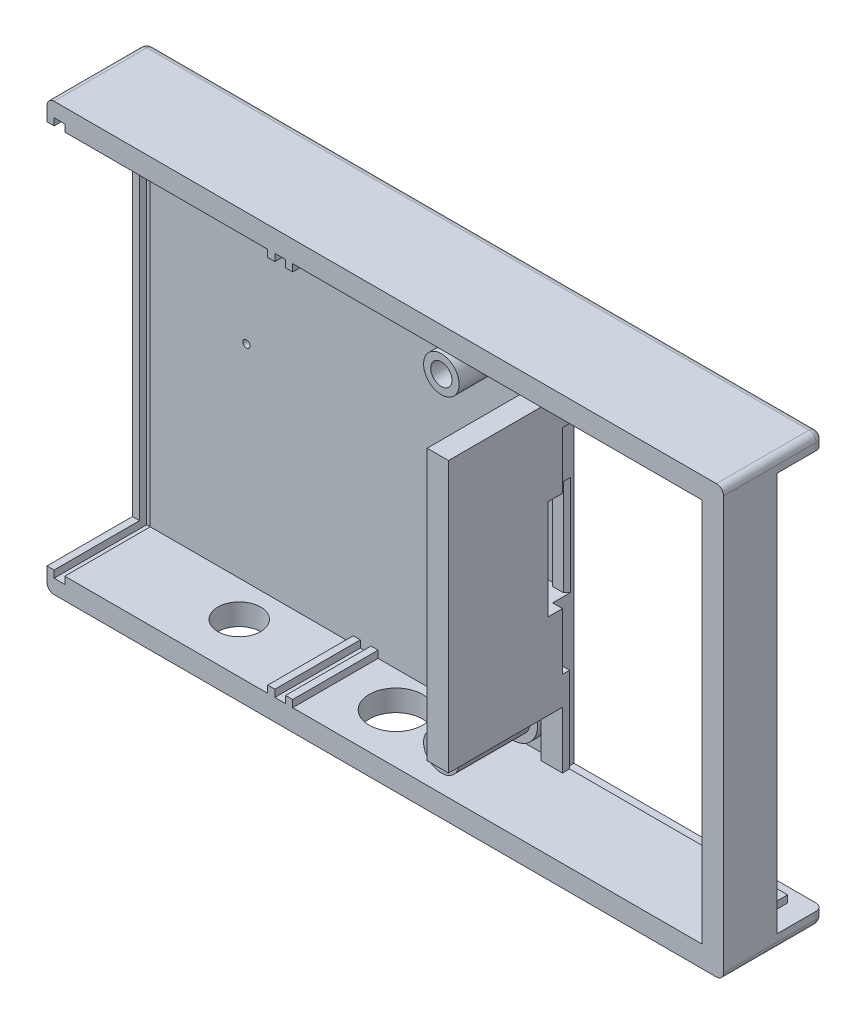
ISO-10303-21;
HEADER;
FILE_DESCRIPTION(('STEP AP214'),'2;1');
FILE_NAME('part.step','',(''),(''),'','','');
FILE_SCHEMA(('AUTOMOTIVE_DESIGN { 1 0 10303 214 1 1 1 1 }'));
ENDSEC;
DATA;
#1=APPLICATION_CONTEXT('core data for automotive mechanical design processes');
#2=APPLICATION_PROTOCOL_DEFINITION('international standard','automotive_design',2000,#1);
#3=PRODUCT_CONTEXT('',#1,'mechanical');
#4=PRODUCT('Part','Part','',(#3));
#5=PRODUCT_RELATED_PRODUCT_CATEGORY('part','',(#4));
#6=PRODUCT_DEFINITION_FORMATION('','',#4);
#7=PRODUCT_DEFINITION_CONTEXT('part definition',#1,'design');
#8=PRODUCT_DEFINITION('design','',#6,#7);
#9=PRODUCT_DEFINITION_SHAPE('','',#8);
#10=(LENGTH_UNIT() NAMED_UNIT(*) SI_UNIT(.MILLI.,.METRE.));
#11=(NAMED_UNIT(*) PLANE_ANGLE_UNIT() SI_UNIT($,.RADIAN.));
#12=(NAMED_UNIT(*) SI_UNIT($,.STERADIAN.) SOLID_ANGLE_UNIT());
#13=UNCERTAINTY_MEASURE_WITH_UNIT(LENGTH_MEASURE(1.E-05),#10,'distance_accuracy_value','');
#14=(GEOMETRIC_REPRESENTATION_CONTEXT(3) GLOBAL_UNCERTAINTY_ASSIGNED_CONTEXT((#13)) GLOBAL_UNIT_ASSIGNED_CONTEXT((#10,
#11,#12)) REPRESENTATION_CONTEXT('',''));
#15=CARTESIAN_POINT('',(0.,0.,0.));
#16=DIRECTION('',(0.,0.,1.));
#17=DIRECTION('',(1.,0.,0.));
#18=AXIS2_PLACEMENT_3D('',#15,#16,#17);
#19=CARTESIAN_POINT('',(-57.,-17.,2.));
#20=DIRECTION('',(0.,0.,1.));
#21=DIRECTION('',(1.,0.,0.));
#22=AXIS2_PLACEMENT_3D('',#19,#20,#21);
#23=PLANE('',#22);
#24=CARTESIAN_POINT('',(-44.,27.,2.));
#25=DIRECTION('',(0.,0.,1.));
#26=DIRECTION('',(1.,0.,0.));
#27=AXIS2_PLACEMENT_3D('',#24,#25,#26);
#28=CIRCLE('',#27,0.499999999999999);
#29=CARTESIAN_POINT('',(-43.5,27.,2.));
#30=VERTEX_POINT('',#29);
#31=EDGE_CURVE('E1732',#30,#30,#28,.T.);
#32=ORIENTED_EDGE('',*,*,#31,.F.);
#33=EDGE_LOOP('',(#32));
#34=FACE_BOUND('',#33,.T.);
#35=CARTESIAN_POINT('',(-44.,12.,2.));
#36=DIRECTION('',(0.,0.,1.));
#37=DIRECTION('',(1.,0.,0.));
#38=AXIS2_PLACEMENT_3D('',#35,#36,#37);
#39=CIRCLE('',#38,0.499999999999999);
#40=CARTESIAN_POINT('',(-43.5,12.,2.));
#41=VERTEX_POINT('',#40);
#42=EDGE_CURVE('E505',#41,#41,#39,.T.);
#43=ORIENTED_EDGE('',*,*,#42,.F.);
#44=EDGE_LOOP('',(#43));
#45=FACE_BOUND('',#44,.T.);
#46=CARTESIAN_POINT('',(-5.61843261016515,-13.,2.));
#47=DIRECTION('',(0.,0.,1.));
#48=DIRECTION('',(1.,0.,0.));
#49=AXIS2_PLACEMENT_3D('',#46,#47,#48);
#50=CIRCLE('',#49,3.5);
#51=CARTESIAN_POINT('',(-2.11843261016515,-13.,2.));
#52=VERTEX_POINT('',#51);
#53=EDGE_CURVE('E801',#52,#52,#50,.T.);
#54=ORIENTED_EDGE('',*,*,#53,.F.);
#55=EDGE_LOOP('',(#54));
#56=FACE_BOUND('',#55,.T.);
#57=CARTESIAN_POINT('',(-5.61843261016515,33.,2.));
#58=DIRECTION('',(0.,0.,1.));
#59=DIRECTION('',(1.,0.,0.));
#60=AXIS2_PLACEMENT_3D('',#57,#58,#59);
#61=CIRCLE('',#60,3.5);
#62=CARTESIAN_POINT('',(-2.11843261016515,33.,2.));
#63=VERTEX_POINT('',#62);
#64=EDGE_CURVE('E793',#63,#63,#61,.T.);
#65=ORIENTED_EDGE('',*,*,#64,.F.);
#66=EDGE_LOOP('',(#65));
#67=FACE_BOUND('',#66,.T.);
#68=DIRECTION('',(-1.,0.,0.));
#69=VECTOR('',#68,1.);
#70=CARTESIAN_POINT('',(-28.0000000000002,-16.,2.));
#71=LINE('',#70,#69);
#72=CARTESIAN_POINT('',(-28.0000000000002,-16.,2.));
#73=VERTEX_POINT('',#72);
#74=CARTESIAN_POINT('',(-29.0000000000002,-16.,2.));
#75=VERTEX_POINT('',#74);
#76=EDGE_CURVE('E57',#73,#75,#71,.T.);
#77=ORIENTED_EDGE('',*,*,#76,.F.);
#78=DIRECTION('',(0.,-1.,0.));
#79=VECTOR('',#78,1.);
#80=CARTESIAN_POINT('',(-28.0000000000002,-16.,2.));
#81=LINE('',#80,#79);
#82=CARTESIAN_POINT('',(-28.0000000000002,-17.,2.));
#83=VERTEX_POINT('',#82);
#84=EDGE_CURVE('E524',#73,#83,#81,.T.);
#85=ORIENTED_EDGE('',*,*,#84,.T.);
#86=DIRECTION('',(1.,0.,0.));
#87=VECTOR('',#86,1.);
#88=CARTESIAN_POINT('',(-57.,-17.,2.));
#89=LINE('',#88,#87);
#90=CARTESIAN_POINT('',(-26.5000000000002,-17.,2.));
#91=VERTEX_POINT('',#90);
#92=EDGE_CURVE('E500',#83,#91,#89,.T.);
#93=ORIENTED_EDGE('',*,*,#92,.T.);
#94=DIRECTION('',(0.,-1.,0.));
#95=VECTOR('',#94,1.);
#96=CARTESIAN_POINT('',(-26.5000000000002,-16.,2.));
#97=LINE('',#96,#95);
#98=CARTESIAN_POINT('',(-26.5000000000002,-16.,2.));
#99=VERTEX_POINT('',#98);
#100=EDGE_CURVE('E554',#99,#91,#97,.T.);
#101=ORIENTED_EDGE('',*,*,#100,.F.);
#102=DIRECTION('',(-1.,0.,0.));
#103=VECTOR('',#102,1.);
#104=CARTESIAN_POINT('',(-25.5000000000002,-16.,2.));
#105=LINE('',#104,#103);
#106=CARTESIAN_POINT('',(-25.5000000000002,-16.,2.));
#107=VERTEX_POINT('',#106);
#108=EDGE_CURVE('E538',#107,#99,#105,.T.);
#109=ORIENTED_EDGE('',*,*,#108,.F.);
#110=DIRECTION('',(0.,-1.,0.));
#111=VECTOR('',#110,1.);
#112=CARTESIAN_POINT('',(-25.5000000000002,-16.,2.));
#113=LINE('',#112,#111);
#114=CARTESIAN_POINT('',(-25.5000000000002,-17.,2.));
#115=VERTEX_POINT('',#114);
#116=EDGE_CURVE('E558',#107,#115,#113,.T.);
#117=ORIENTED_EDGE('',*,*,#116,.T.);
#118=CARTESIAN_POINT('',(-1.61843261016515,-17.,2.));
#119=VERTEX_POINT('',#118);
#120=EDGE_CURVE('E1122',#115,#119,#89,.T.);
#121=ORIENTED_EDGE('',*,*,#120,.T.);
#122=DIRECTION('',(0.,-1.,0.));
#123=VECTOR('',#122,1.);
#124=CARTESIAN_POINT('',(-1.61843261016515,-17.,2.));
#125=LINE('',#124,#123);
#126=CARTESIAN_POINT('',(-1.61843261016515,3.,2.));
#127=VERTEX_POINT('',#126);
#128=EDGE_CURVE('E1007',#127,#119,#125,.T.);
#129=ORIENTED_EDGE('',*,*,#128,.F.);
#130=DIRECTION('',(1.,0.,0.));
#131=VECTOR('',#130,1.);
#132=CARTESIAN_POINT('',(-57.,2.99999999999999,2.));
#133=LINE('',#132,#131);
#134=CARTESIAN_POINT('',(-5.5,2.99999999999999,2.));
#135=VERTEX_POINT('',#134);
#136=EDGE_CURVE('E859',#135,#127,#133,.T.);
#137=ORIENTED_EDGE('',*,*,#136,.F.);
#138=DIRECTION('',(0.,1.,0.));
#139=VECTOR('',#138,1.);
#140=CARTESIAN_POINT('',(-5.5,17.,2.));
#141=LINE('',#140,#139);
#142=CARTESIAN_POINT('',(-5.5,17.,2.));
#143=VERTEX_POINT('',#142);
#144=EDGE_CURVE('E1166',#135,#143,#141,.T.);
#145=ORIENTED_EDGE('',*,*,#144,.T.);
#146=DIRECTION('',(-1.,0.,0.));
#147=VECTOR('',#146,1.);
#148=CARTESIAN_POINT('',(-57.,17.,2.));
#149=LINE('',#148,#147);
#150=CARTESIAN_POINT('',(-1.61843261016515,17.,2.));
#151=VERTEX_POINT('',#150);
#152=EDGE_CURVE('E866',#151,#143,#149,.T.);
#153=ORIENTED_EDGE('',*,*,#152,.F.);
#154=CARTESIAN_POINT('',(-1.61843261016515,37.,2.));
#155=VERTEX_POINT('',#154);
#156=EDGE_CURVE('E1008',#155,#151,#125,.T.);
#157=ORIENTED_EDGE('',*,*,#156,.F.);
#158=DIRECTION('',(-1.,0.,0.));
#159=VECTOR('',#158,1.);
#160=CARTESIAN_POINT('',(-57.,37.,2.));
#161=LINE('',#160,#159);
#162=CARTESIAN_POINT('',(-25.5000000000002,37.,2.));
#163=VERTEX_POINT('',#162);
#164=EDGE_CURVE('E1130',#155,#163,#161,.T.);
#165=ORIENTED_EDGE('',*,*,#164,.T.);
#166=DIRECTION('',(0.,1.,0.));
#167=VECTOR('',#166,1.);
#168=CARTESIAN_POINT('',(-25.5000000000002,36.0000000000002,2.));
#169=LINE('',#168,#167);
#170=CARTESIAN_POINT('',(-25.5000000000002,36.0000000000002,2.));
#171=VERTEX_POINT('',#170);
#172=EDGE_CURVE('E591',#171,#163,#169,.T.);
#173=ORIENTED_EDGE('',*,*,#172,.F.);
#174=DIRECTION('',(1.,0.,0.));
#175=VECTOR('',#174,1.);
#176=CARTESIAN_POINT('',(-26.5000000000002,36.0000000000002,2.));
#177=LINE('',#176,#175);
#178=CARTESIAN_POINT('',(-26.5000000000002,36.0000000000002,2.));
#179=VERTEX_POINT('',#178);
#180=EDGE_CURVE('E573',#179,#171,#177,.T.);
#181=ORIENTED_EDGE('',*,*,#180,.F.);
#182=DIRECTION('',(0.,1.,0.));
#183=VECTOR('',#182,1.);
#184=CARTESIAN_POINT('',(-26.5000000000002,36.0000000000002,2.));
#185=LINE('',#184,#183);
#186=CARTESIAN_POINT('',(-26.5000000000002,37.,2.));
#187=VERTEX_POINT('',#186);
#188=EDGE_CURVE('E595',#179,#187,#185,.T.);
#189=ORIENTED_EDGE('',*,*,#188,.T.);
#190=CARTESIAN_POINT('',(-28.0000000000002,37.,2.));
#191=VERTEX_POINT('',#190);
#192=EDGE_CURVE('E1135',#187,#191,#161,.T.);
#193=ORIENTED_EDGE('',*,*,#192,.T.);
#194=DIRECTION('',(0.,1.,0.));
#195=VECTOR('',#194,1.);
#196=CARTESIAN_POINT('',(-28.0000000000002,36.0000000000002,2.));
#197=LINE('',#196,#195);
#198=CARTESIAN_POINT('',(-28.0000000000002,36.0000000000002,2.));
#199=VERTEX_POINT('',#198);
#200=EDGE_CURVE('E621',#199,#191,#197,.T.);
#201=ORIENTED_EDGE('',*,*,#200,.F.);
#202=DIRECTION('',(1.,0.,0.));
#203=VECTOR('',#202,1.);
#204=CARTESIAN_POINT('',(-28.0000000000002,36.0000000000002,2.));
#205=LINE('',#204,#203);
#206=CARTESIAN_POINT('',(-29.0000000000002,36.0000000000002,2.));
#207=VERTEX_POINT('',#206);
#208=EDGE_CURVE('E617',#207,#199,#205,.T.);
#209=ORIENTED_EDGE('',*,*,#208,.F.);
#210=DIRECTION('',(0.,1.,0.));
#211=VECTOR('',#210,1.);
#212=CARTESIAN_POINT('',(-29.0000000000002,36.0000000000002,2.));
#213=LINE('',#212,#211);
#214=CARTESIAN_POINT('',(-29.0000000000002,37.,2.));
#215=VERTEX_POINT('',#214);
#216=EDGE_CURVE('E625',#207,#215,#213,.T.);
#217=ORIENTED_EDGE('',*,*,#216,.T.);
#218=CARTESIAN_POINT('',(-57.5,37.,2.));
#219=VERTEX_POINT('',#218);
#220=EDGE_CURVE('E1424',#215,#219,#161,.T.);
#221=ORIENTED_EDGE('',*,*,#220,.T.);
#222=DIRECTION('',(0.,1.,0.));
#223=VECTOR('',#222,1.);
#224=CARTESIAN_POINT('',(-57.5,37.,2.));
#225=LINE('',#224,#223);
#226=CARTESIAN_POINT('',(-57.5,-17.,2.));
#227=VERTEX_POINT('',#226);
#228=EDGE_CURVE('E699',#227,#219,#225,.T.);
#229=ORIENTED_EDGE('',*,*,#228,.F.);
#230=CARTESIAN_POINT('',(-29.0000000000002,-17.,2.));
#231=VERTEX_POINT('',#230);
#232=EDGE_CURVE('E1129',#227,#231,#89,.T.);
#233=ORIENTED_EDGE('',*,*,#232,.T.);
#234=DIRECTION('',(0.,-1.,0.));
#235=VECTOR('',#234,1.);
#236=CARTESIAN_POINT('',(-29.0000000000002,-16.,2.));
#237=LINE('',#236,#235);
#238=EDGE_CURVE('E62',#75,#231,#237,.T.);
#239=ORIENTED_EDGE('',*,*,#238,.F.);
#240=EDGE_LOOP('',(#77,#85,#93,#101,#109,#117,#121,#129,#137,#145,#153,#157,#165,#173,#181,#189,
#193,#201,#209,#217,#221,#229,#233,#239));
#241=FACE_BOUND('',#240,.T.);
#242=ADVANCED_FACE('F41',(#34,#45,#56,#67,#241),#23,.T.);
#243=CARTESIAN_POINT('',(-57.,-17.,2.));
#244=DIRECTION('',(0.,-1.,0.));
#245=DIRECTION('',(1.,0.,0.));
#246=AXIS2_PLACEMENT_3D('',#243,#244,#245);
#247=PLANE('',#246);
#248=DIRECTION('',(0.,0.,-1.));
#249=VECTOR('',#248,1.);
#250=CARTESIAN_POINT('',(-28.0000000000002,-17.,2.));
#251=LINE('',#250,#249);
#252=CARTESIAN_POINT('',(-28.0000000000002,-17.,14.));
#253=VERTEX_POINT('',#252);
#254=EDGE_CURVE('E498',#253,#83,#251,.T.);
#255=ORIENTED_EDGE('',*,*,#254,.F.);
#256=DIRECTION('',(1.,0.,0.));
#257=VECTOR('',#256,1.);
#258=CARTESIAN_POINT('',(-57.,-17.,14.));
#259=LINE('',#258,#257);
#260=CARTESIAN_POINT('',(-26.5000000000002,-17.,14.));
#261=VERTEX_POINT('',#260);
#262=EDGE_CURVE('E477',#253,#261,#259,.T.);
#263=ORIENTED_EDGE('',*,*,#262,.T.);
#264=DIRECTION('',(0.,0.,1.));
#265=VECTOR('',#264,1.);
#266=CARTESIAN_POINT('',(-26.5000000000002,-17.,14.));
#267=LINE('',#266,#265);
#268=EDGE_CURVE('E531',#91,#261,#267,.T.);
#269=ORIENTED_EDGE('',*,*,#268,.F.);
#270=ORIENTED_EDGE('',*,*,#92,.F.);
#271=EDGE_LOOP('',(#255,#263,#269,#270));
#272=FACE_BOUND('',#271,.T.);
#273=ADVANCED_FACE('F499',(#272),#247,.F.);
#274=CARTESIAN_POINT('',(-40.,-17.,7.));
#275=DIRECTION('',(0.,-1.,0.));
#276=DIRECTION('',(1.,0.,0.));
#277=AXIS2_PLACEMENT_3D('',#274,#275,#276);
#278=CIRCLE('',#277,3.);
#279=CARTESIAN_POINT('',(-37.,-17.,7.));
#280=VERTEX_POINT('',#279);
#281=EDGE_CURVE('E1710',#280,#280,#278,.F.);
#282=ORIENTED_EDGE('',*,*,#281,.F.);
#283=EDGE_LOOP('',(#282));
#284=FACE_BOUND('',#283,.T.);
#285=DIRECTION('',(0.,0.,1.));
#286=VECTOR('',#285,1.);
#287=CARTESIAN_POINT('',(-29.0000000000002,-17.,2.));
#288=LINE('',#287,#286);
#289=CARTESIAN_POINT('',(-29.0000000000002,-17.,14.));
#290=VERTEX_POINT('',#289);
#291=EDGE_CURVE('E504',#231,#290,#288,.T.);
#292=ORIENTED_EDGE('',*,*,#291,.F.);
#293=ORIENTED_EDGE('',*,*,#232,.F.);
#294=DIRECTION('',(0.,0.,-1.));
#295=VECTOR('',#294,1.);
#296=CARTESIAN_POINT('',(-57.5,-17.,1.));
#297=LINE('',#296,#295);
#298=CARTESIAN_POINT('',(-57.5,-17.,14.));
#299=VERTEX_POINT('',#298);
#300=EDGE_CURVE('E669',#299,#227,#297,.T.);
#301=ORIENTED_EDGE('',*,*,#300,.F.);
#302=EDGE_CURVE('E492',#299,#290,#259,.T.);
#303=ORIENTED_EDGE('',*,*,#302,.T.);
#304=EDGE_LOOP('',(#292,#293,#301,#303));
#305=FACE_BOUND('',#304,.T.);
#306=ADVANCED_FACE('F1446',(#284,#305),#247,.F.);
#307=CARTESIAN_POINT('',(-18.,-17.,7.00286988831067));
#308=DIRECTION('',(0.,-1.,0.));
#309=DIRECTION('',(1.,0.,0.));
#310=AXIS2_PLACEMENT_3D('',#307,#308,#309);
#311=CIRCLE('',#310,3.75);
#312=CARTESIAN_POINT('',(-14.25,-17.,7.00286988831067));
#313=VERTEX_POINT('',#312);
#314=EDGE_CURVE('E1720',#313,#313,#311,.F.);
#315=ORIENTED_EDGE('',*,*,#314,.F.);
#316=EDGE_LOOP('',(#315));
#317=FACE_BOUND('',#316,.T.);
#318=DIRECTION('',(0.,0.,-1.));
#319=VECTOR('',#318,1.);
#320=CARTESIAN_POINT('',(-25.5000000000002,-17.,14.));
#321=LINE('',#320,#319);
#322=CARTESIAN_POINT('',(-25.5000000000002,-17.,14.));
#323=VERTEX_POINT('',#322);
#324=EDGE_CURVE('E527',#323,#115,#321,.T.);
#325=ORIENTED_EDGE('',*,*,#324,.F.);
#326=CARTESIAN_POINT('',(32.,-17.,14.));
#327=VERTEX_POINT('',#326);
#328=EDGE_CURVE('E493',#323,#327,#259,.T.);
#329=ORIENTED_EDGE('',*,*,#328,.T.);
#330=DIRECTION('',(0.,0.,-1.));
#331=VECTOR('',#330,1.);
#332=CARTESIAN_POINT('',(32.,-17.,6.5));
#333=LINE('',#332,#331);
#334=CARTESIAN_POINT('',(32.,-17.,6.5));
#335=VERTEX_POINT('',#334);
#336=EDGE_CURVE('E939',#327,#335,#333,.T.);
#337=ORIENTED_EDGE('',*,*,#336,.T.);
#338=DIRECTION('',(0.,0.,-1.));
#339=VECTOR('',#338,1.);
#340=CARTESIAN_POINT('',(32.,-17.,6.5));
#341=LINE('',#340,#339);
#342=CARTESIAN_POINT('',(32.,-17.,2.));
#343=VERTEX_POINT('',#342);
#344=EDGE_CURVE('E1041',#335,#343,#341,.T.);
#345=ORIENTED_EDGE('',*,*,#344,.T.);
#346=DIRECTION('',(1.,0.,0.));
#347=VECTOR('',#346,1.);
#348=CARTESIAN_POINT('',(0.,-17.,2.));
#349=LINE('',#348,#347);
#350=CARTESIAN_POINT('',(1.38156738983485,-17.,2.));
#351=VERTEX_POINT('',#350);
#352=EDGE_CURVE('E1055',#351,#343,#349,.T.);
#353=ORIENTED_EDGE('',*,*,#352,.F.);
#354=DIRECTION('',(0.,0.,-1.));
#355=VECTOR('',#354,1.);
#356=CARTESIAN_POINT('',(1.38156738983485,-17.,19.));
#357=LINE('',#356,#355);
#358=CARTESIAN_POINT('',(1.38156738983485,-17.,3.));
#359=VERTEX_POINT('',#358);
#360=EDGE_CURVE('E1019',#359,#351,#357,.T.);
#361=ORIENTED_EDGE('',*,*,#360,.F.);
#362=DIRECTION('',(1.,0.,0.));
#363=VECTOR('',#362,1.);
#364=CARTESIAN_POINT('',(1.38156738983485,-17.,3.));
#365=LINE('',#364,#363);
#366=CARTESIAN_POINT('',(-1.61843261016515,-17.,3.));
#367=VERTEX_POINT('',#366);
#368=EDGE_CURVE('E992',#367,#359,#365,.T.);
#369=ORIENTED_EDGE('',*,*,#368,.F.);
#370=DIRECTION('',(0.,0.,-1.));
#371=VECTOR('',#370,1.);
#372=CARTESIAN_POINT('',(-1.61843261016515,-17.,19.));
#373=LINE('',#372,#371);
#374=EDGE_CURVE('E1022',#367,#119,#373,.T.);
#375=ORIENTED_EDGE('',*,*,#374,.T.);
#376=ORIENTED_EDGE('',*,*,#120,.F.);
#377=EDGE_LOOP('',(#325,#329,#337,#345,#353,#361,#369,#375,#376));
#378=FACE_BOUND('',#377,.T.);
#379=ADVANCED_FACE('F1467',(#317,#378),#247,.F.);
#380=CARTESIAN_POINT('',(-57.,37.,2.));
#381=DIRECTION('',(0.,1.,0.));
#382=DIRECTION('',(-1.,0.,0.));
#383=AXIS2_PLACEMENT_3D('',#380,#381,#382);
#384=PLANE('',#383);
#385=DIRECTION('',(0.,0.,-1.));
#386=VECTOR('',#385,1.);
#387=CARTESIAN_POINT('',(-26.5000000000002,37.0000000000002,2.));
#388=LINE('',#387,#386);
#389=CARTESIAN_POINT('',(-26.5000000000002,37.0000000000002,14.));
#390=VERTEX_POINT('',#389);
#391=EDGE_CURVE('E561',#390,#187,#388,.T.);
#392=ORIENTED_EDGE('',*,*,#391,.F.);
#393=DIRECTION('',(-1.,0.,0.));
#394=VECTOR('',#393,1.);
#395=CARTESIAN_POINT('',(-57.,37.,14.));
#396=LINE('',#395,#394);
#397=CARTESIAN_POINT('',(-28.0000000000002,37.,14.));
#398=VERTEX_POINT('',#397);
#399=EDGE_CURVE('E1123',#390,#398,#396,.T.);
#400=ORIENTED_EDGE('',*,*,#399,.T.);
#401=DIRECTION('',(0.,0.,1.));
#402=VECTOR('',#401,1.);
#403=CARTESIAN_POINT('',(-28.0000000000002,37.0000000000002,2.));
#404=LINE('',#403,#402);
#405=EDGE_CURVE('E598',#191,#398,#404,.T.);
#406=ORIENTED_EDGE('',*,*,#405,.F.);
#407=ORIENTED_EDGE('',*,*,#192,.F.);
#408=EDGE_LOOP('',(#392,#400,#406,#407));
#409=FACE_BOUND('',#408,.T.);
#410=ADVANCED_FACE('F1408',(#409),#384,.F.);
#411=DIRECTION('',(0.,0.,1.));
#412=VECTOR('',#411,1.);
#413=CARTESIAN_POINT('',(-25.5000000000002,37.0000000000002,2.));
#414=LINE('',#413,#412);
#415=CARTESIAN_POINT('',(-25.5000000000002,37.,14.));
#416=VERTEX_POINT('',#415);
#417=EDGE_CURVE('E565',#163,#416,#414,.T.);
#418=ORIENTED_EDGE('',*,*,#417,.F.);
#419=ORIENTED_EDGE('',*,*,#164,.F.);
#420=DIRECTION('',(0.,0.,-1.));
#421=VECTOR('',#420,1.);
#422=CARTESIAN_POINT('',(-1.61843261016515,37.,19.));
#423=LINE('',#422,#421);
#424=CARTESIAN_POINT('',(-1.61843261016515,37.,3.));
#425=VERTEX_POINT('',#424);
#426=EDGE_CURVE('E1026',#425,#155,#423,.T.);
#427=ORIENTED_EDGE('',*,*,#426,.F.);
#428=DIRECTION('',(-1.,0.,0.));
#429=VECTOR('',#428,1.);
#430=CARTESIAN_POINT('',(-1.61843261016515,37.,3.));
#431=LINE('',#430,#429);
#432=CARTESIAN_POINT('',(1.38156738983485,37.,3.));
#433=VERTEX_POINT('',#432);
#434=EDGE_CURVE('E967',#433,#425,#431,.T.);
#435=ORIENTED_EDGE('',*,*,#434,.F.);
#436=DIRECTION('',(0.,0.,-1.));
#437=VECTOR('',#436,1.);
#438=CARTESIAN_POINT('',(1.38156738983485,37.,19.));
#439=LINE('',#438,#437);
#440=CARTESIAN_POINT('',(1.38156738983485,37.,2.));
#441=VERTEX_POINT('',#440);
#442=EDGE_CURVE('E1029',#433,#441,#439,.T.);
#443=ORIENTED_EDGE('',*,*,#442,.T.);
#444=DIRECTION('',(-1.,0.,0.));
#445=VECTOR('',#444,1.);
#446=CARTESIAN_POINT('',(0.,37.,2.));
#447=LINE('',#446,#445);
#448=CARTESIAN_POINT('',(32.,37.,2.));
#449=VERTEX_POINT('',#448);
#450=EDGE_CURVE('E1095',#449,#441,#447,.T.);
#451=ORIENTED_EDGE('',*,*,#450,.F.);
#452=DIRECTION('',(0.,0.,1.));
#453=VECTOR('',#452,1.);
#454=CARTESIAN_POINT('',(32.,37.,0.));
#455=LINE('',#454,#453);
#456=CARTESIAN_POINT('',(32.,37.,6.5));
#457=VERTEX_POINT('',#456);
#458=EDGE_CURVE('E1112',#449,#457,#455,.T.);
#459=ORIENTED_EDGE('',*,*,#458,.T.);
#460=DIRECTION('',(0.,0.,-1.));
#461=VECTOR('',#460,1.);
#462=CARTESIAN_POINT('',(31.9999999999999,37.,6.5));
#463=LINE('',#462,#461);
#464=CARTESIAN_POINT('',(31.9999999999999,37.,14.));
#465=VERTEX_POINT('',#464);
#466=EDGE_CURVE('E927',#465,#457,#463,.T.);
#467=ORIENTED_EDGE('',*,*,#466,.F.);
#468=EDGE_CURVE('E1119',#465,#416,#396,.T.);
#469=ORIENTED_EDGE('',*,*,#468,.T.);
#470=EDGE_LOOP('',(#418,#419,#427,#435,#443,#451,#459,#467,#469));
#471=FACE_BOUND('',#470,.T.);
#472=ADVANCED_FACE('F1349',(#471),#384,.F.);
#473=DIRECTION('',(0.,0.,-1.));
#474=VECTOR('',#473,1.);
#475=CARTESIAN_POINT('',(-29.0000000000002,37.0000000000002,2.));
#476=LINE('',#475,#474);
#477=CARTESIAN_POINT('',(-29.0000000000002,37.0000000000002,14.));
#478=VERTEX_POINT('',#477);
#479=EDGE_CURVE('E602',#478,#215,#476,.T.);
#480=ORIENTED_EDGE('',*,*,#479,.F.);
#481=CARTESIAN_POINT('',(-57.5,37.,14.));
#482=VERTEX_POINT('',#481);
#483=EDGE_CURVE('E1396',#478,#482,#396,.T.);
#484=ORIENTED_EDGE('',*,*,#483,.T.);
#485=DIRECTION('',(0.,0.,1.));
#486=VECTOR('',#485,1.);
#487=CARTESIAN_POINT('',(-57.5,37.,1.));
#488=LINE('',#487,#486);
#489=EDGE_CURVE('E639',#219,#482,#488,.T.);
#490=ORIENTED_EDGE('',*,*,#489,.F.);
#491=ORIENTED_EDGE('',*,*,#220,.F.);
#492=EDGE_LOOP('',(#480,#484,#490,#491));
#493=FACE_BOUND('',#492,.T.);
#494=ADVANCED_FACE('F1425',(#493),#384,.F.);
#495=CARTESIAN_POINT('',(-59.,37.,2.));
#496=VERTEX_POINT('',#495);
#497=CARTESIAN_POINT('',(-60.,37.,2.));
#498=VERTEX_POINT('',#497);
#499=EDGE_CURVE('E1128',#496,#498,#161,.T.);
#500=ORIENTED_EDGE('',*,*,#499,.F.);
#501=DIRECTION('',(0.,0.,-1.));
#502=VECTOR('',#501,1.);
#503=CARTESIAN_POINT('',(-59.,37.,1.));
#504=LINE('',#503,#502);
#505=CARTESIAN_POINT('',(-59.,37.,14.));
#506=VERTEX_POINT('',#505);
#507=EDGE_CURVE('E636',#506,#496,#504,.T.);
#508=ORIENTED_EDGE('',*,*,#507,.F.);
#509=CARTESIAN_POINT('',(-60.,37.,14.));
#510=VERTEX_POINT('',#509);
#511=EDGE_CURVE('E1118',#506,#510,#396,.T.);
#512=ORIENTED_EDGE('',*,*,#511,.T.);
#513=DIRECTION('',(0.,0.,1.));
#514=VECTOR('',#513,1.);
#515=CARTESIAN_POINT('',(-60.,37.,2.));
#516=LINE('',#515,#514);
#517=EDGE_CURVE('E743',#498,#510,#516,.T.);
#518=ORIENTED_EDGE('',*,*,#517,.F.);
#519=EDGE_LOOP('',(#500,#508,#512,#518));
#520=FACE_BOUND('',#519,.T.);
#521=ADVANCED_FACE('F1393',(#520),#384,.F.);
#522=CARTESIAN_POINT('',(-60.,-17.,14.));
#523=VERTEX_POINT('',#522);
#524=CARTESIAN_POINT('',(-59.,-17.,14.));
#525=VERTEX_POINT('',#524);
#526=EDGE_CURVE('E495',#523,#525,#259,.T.);
#527=ORIENTED_EDGE('',*,*,#526,.T.);
#528=DIRECTION('',(0.,0.,1.));
#529=VECTOR('',#528,1.);
#530=CARTESIAN_POINT('',(-59.,-17.,1.));
#531=LINE('',#530,#529);
#532=CARTESIAN_POINT('',(-59.,-17.,2.));
#533=VERTEX_POINT('',#532);
#534=EDGE_CURVE('E663',#533,#525,#531,.T.);
#535=ORIENTED_EDGE('',*,*,#534,.F.);
#536=CARTESIAN_POINT('',(-60.,-17.,2.));
#537=VERTEX_POINT('',#536);
#538=EDGE_CURVE('E1124',#537,#533,#89,.T.);
#539=ORIENTED_EDGE('',*,*,#538,.F.);
#540=DIRECTION('',(0.,0.,-1.));
#541=VECTOR('',#540,1.);
#542=CARTESIAN_POINT('',(-60.,-17.,2.));
#543=LINE('',#542,#541);
#544=EDGE_CURVE('E747',#523,#537,#543,.T.);
#545=ORIENTED_EDGE('',*,*,#544,.F.);
#546=EDGE_LOOP('',(#527,#535,#539,#545));
#547=FACE_BOUND('',#546,.T.);
#548=ADVANCED_FACE('F1689',(#547),#247,.F.);
#549=DIRECTION('',(0.,-1.,0.));
#550=VECTOR('',#549,1.);
#551=CARTESIAN_POINT('',(-59.,37.,2.));
#552=LINE('',#551,#550);
#553=EDGE_CURVE('E692',#496,#533,#552,.T.);
#554=ORIENTED_EDGE('',*,*,#553,.F.);
#555=ORIENTED_EDGE('',*,*,#499,.T.);
#556=DIRECTION('',(0.,1.,0.));
#557=VECTOR('',#556,1.);
#558=CARTESIAN_POINT('',(-60.,37.,2.));
#559=LINE('',#558,#557);
#560=EDGE_CURVE('E739',#537,#498,#559,.T.);
#561=ORIENTED_EDGE('',*,*,#560,.F.);
#562=ORIENTED_EDGE('',*,*,#538,.T.);
#563=EDGE_LOOP('',(#554,#555,#561,#562));
#564=FACE_BOUND('',#563,.T.);
#565=ADVANCED_FACE('F1433',(#564),#23,.T.);
#566=CARTESIAN_POINT('',(-5.61843261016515,33.,0.));
#567=DIRECTION('',(0.,0.,1.));
#568=DIRECTION('',(1.,0.,0.));
#569=AXIS2_PLACEMENT_3D('',#566,#567,#568);
#570=CYLINDRICAL_SURFACE('',#569,1.5);
#571=CARTESIAN_POINT('',(-5.61843261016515,33.,13.));
#572=DIRECTION('',(0.,0.,1.));
#573=DIRECTION('',(1.,0.,0.));
#574=AXIS2_PLACEMENT_3D('',#571,#572,#573);
#575=CIRCLE('',#574,1.5);
#576=CARTESIAN_POINT('',(-4.11843261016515,33.,13.));
#577=VERTEX_POINT('',#576);
#578=EDGE_CURVE('E769',#577,#577,#575,.T.);
#579=ORIENTED_EDGE('',*,*,#578,.T.);
#580=EDGE_LOOP('',(#579));
#581=FACE_BOUND('',#580,.T.);
#582=CARTESIAN_POINT('',(-5.61843261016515,33.,2.));
#583=DIRECTION('',(0.,0.,-1.));
#584=DIRECTION('',(-1.,0.,0.));
#585=AXIS2_PLACEMENT_3D('',#582,#583,#584);
#586=CIRCLE('',#585,1.5);
#587=CARTESIAN_POINT('',(-7.11843261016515,33.,2.));
#588=VERTEX_POINT('',#587);
#589=EDGE_CURVE('E759',#588,#588,#586,.F.);
#590=ORIENTED_EDGE('',*,*,#589,.F.);
#591=EDGE_LOOP('',(#590));
#592=FACE_BOUND('',#591,.T.);
#593=ADVANCED_FACE('F1688',(#581,#592),#570,.F.);
#594=CARTESIAN_POINT('',(-5.61843261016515,-13.,0.));
#595=DIRECTION('',(0.,0.,1.));
#596=DIRECTION('',(1.,0.,0.));
#597=AXIS2_PLACEMENT_3D('',#594,#595,#596);
#598=CYLINDRICAL_SURFACE('',#597,1.5);
#599=CARTESIAN_POINT('',(-5.61843261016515,-13.,13.));
#600=DIRECTION('',(0.,0.,1.));
#601=DIRECTION('',(1.,0.,0.));
#602=AXIS2_PLACEMENT_3D('',#599,#600,#601);
#603=CIRCLE('',#602,1.5);
#604=CARTESIAN_POINT('',(-4.11843261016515,-13.,13.));
#605=VERTEX_POINT('',#604);
#606=EDGE_CURVE('E781',#605,#605,#603,.T.);
#607=ORIENTED_EDGE('',*,*,#606,.T.);
#608=EDGE_LOOP('',(#607));
#609=FACE_BOUND('',#608,.T.);
#610=CARTESIAN_POINT('',(-5.61843261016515,-13.,2.));
#611=DIRECTION('',(0.,0.,-1.));
#612=DIRECTION('',(-1.,0.,0.));
#613=AXIS2_PLACEMENT_3D('',#610,#611,#612);
#614=CIRCLE('',#613,1.5);
#615=CARTESIAN_POINT('',(-7.11843261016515,-13.,2.));
#616=VERTEX_POINT('',#615);
#617=EDGE_CURVE('E768',#616,#616,#614,.F.);
#618=ORIENTED_EDGE('',*,*,#617,.F.);
#619=EDGE_LOOP('',(#618));
#620=FACE_BOUND('',#619,.T.);
#621=ADVANCED_FACE('F1694',(#609,#620),#598,.F.);
#622=CARTESIAN_POINT('',(-5.61843261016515,33.,3.));
#623=DIRECTION('',(0.,0.,1.));
#624=DIRECTION('',(1.,0.,0.));
#625=AXIS2_PLACEMENT_3D('',#622,#623,#624);
#626=PLANE('',#625);
#627=CARTESIAN_POINT('',(-5.61843261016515,33.,3.));
#628=DIRECTION('',(0.,0.,1.));
#629=DIRECTION('',(1.,0.,0.));
#630=AXIS2_PLACEMENT_3D('',#627,#628,#629);
#631=CIRCLE('',#630,3.5);
#632=CARTESIAN_POINT('',(-2.11843261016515,33.,3.));
#633=VERTEX_POINT('',#632);
#634=EDGE_CURVE('E797',#633,#633,#631,.T.);
#635=ORIENTED_EDGE('',*,*,#634,.T.);
#636=EDGE_LOOP('',(#635));
#637=FACE_BOUND('',#636,.T.);
#638=CARTESIAN_POINT('',(-5.61843261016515,33.,3.));
#639=DIRECTION('',(0.,0.,1.));
#640=DIRECTION('',(1.,0.,0.));
#641=AXIS2_PLACEMENT_3D('',#638,#639,#640);
#642=CIRCLE('',#641,2.5);
#643=CARTESIAN_POINT('',(-3.11843261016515,33.,3.));
#644=VERTEX_POINT('',#643);
#645=EDGE_CURVE('E773',#644,#644,#642,.T.);
#646=ORIENTED_EDGE('',*,*,#645,.F.);
#647=EDGE_LOOP('',(#646));
#648=FACE_BOUND('',#647,.T.);
#649=ADVANCED_FACE('F2716',(#637,#648),#626,.T.);
#650=CARTESIAN_POINT('',(-5.61843261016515,-13.,3.));
#651=DIRECTION('',(0.,0.,1.));
#652=DIRECTION('',(1.,0.,0.));
#653=AXIS2_PLACEMENT_3D('',#650,#651,#652);
#654=PLANE('',#653);
#655=CARTESIAN_POINT('',(-5.61843261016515,-13.,3.));
#656=DIRECTION('',(0.,0.,1.));
#657=DIRECTION('',(1.,0.,0.));
#658=AXIS2_PLACEMENT_3D('',#655,#656,#657);
#659=CIRCLE('',#658,3.5);
#660=CARTESIAN_POINT('',(-2.11843261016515,-13.,3.));
#661=VERTEX_POINT('',#660);
#662=EDGE_CURVE('E805',#661,#661,#659,.T.);
#663=ORIENTED_EDGE('',*,*,#662,.T.);
#664=EDGE_LOOP('',(#663));
#665=FACE_BOUND('',#664,.T.);
#666=CARTESIAN_POINT('',(-5.61843261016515,-13.,3.));
#667=DIRECTION('',(0.,0.,1.));
#668=DIRECTION('',(1.,0.,0.));
#669=AXIS2_PLACEMENT_3D('',#666,#667,#668);
#670=CIRCLE('',#669,2.5);
#671=CARTESIAN_POINT('',(-3.11843261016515,-13.,3.));
#672=VERTEX_POINT('',#671);
#673=EDGE_CURVE('E785',#672,#672,#670,.T.);
#674=ORIENTED_EDGE('',*,*,#673,.F.);
#675=EDGE_LOOP('',(#674));
#676=FACE_BOUND('',#675,.T.);
#677=ADVANCED_FACE('F2720',(#665,#676),#654,.T.);
#678=CARTESIAN_POINT('',(1.38156738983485,17.,5.));
#679=DIRECTION('',(0.,1.,0.));
#680=DIRECTION('',(0.,0.,1.));
#681=AXIS2_PLACEMENT_3D('',#678,#679,#680);
#682=PLANE('',#681);
#683=ORIENTED_EDGE('',*,*,#152,.T.);
#684=DIRECTION('',(0.707106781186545,0.,-0.70710678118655));
#685=VECTOR('',#684,1.);
#686=CARTESIAN_POINT('',(-3.55921630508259,17.,0.0592163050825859));
#687=LINE('',#686,#685);
#688=CARTESIAN_POINT('',(-4.5,17.,0.999999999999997));
#689=VERTEX_POINT('',#688);
#690=EDGE_CURVE('E1173',#143,#689,#687,.T.);
#691=ORIENTED_EDGE('',*,*,#690,.T.);
#692=DIRECTION('',(0.,0.,1.));
#693=VECTOR('',#692,1.);
#694=CARTESIAN_POINT('',(-4.5,17.,0.5));
#695=LINE('',#694,#693);
#696=CARTESIAN_POINT('',(-4.5,17.,0.5));
#697=VERTEX_POINT('',#696);
#698=EDGE_CURVE('E837',#697,#689,#695,.T.);
#699=ORIENTED_EDGE('',*,*,#698,.F.);
#700=DIRECTION('',(-1.,0.,0.));
#701=VECTOR('',#700,1.);
#702=CARTESIAN_POINT('',(-4.5,17.,0.5));
#703=LINE('',#702,#701);
#704=CARTESIAN_POINT('',(-2.,17.,0.5));
#705=VERTEX_POINT('',#704);
#706=EDGE_CURVE('E816',#705,#697,#703,.T.);
#707=ORIENTED_EDGE('',*,*,#706,.F.);
#708=DIRECTION('',(0.,0.,1.));
#709=VECTOR('',#708,1.);
#710=CARTESIAN_POINT('',(-2.,17.,0.5));
#711=LINE('',#710,#709);
#712=CARTESIAN_POINT('',(-2.,17.,1.));
#713=VERTEX_POINT('',#712);
#714=EDGE_CURVE('E828',#705,#713,#711,.T.);
#715=ORIENTED_EDGE('',*,*,#714,.T.);
#716=DIRECTION('',(1.,0.,0.));
#717=VECTOR('',#716,1.);
#718=CARTESIAN_POINT('',(-6.,17.,1.));
#719=LINE('',#718,#717);
#720=CARTESIAN_POINT('',(-0.5,17.,1.));
#721=VERTEX_POINT('',#720);
#722=EDGE_CURVE('E850',#713,#721,#719,.T.);
#723=ORIENTED_EDGE('',*,*,#722,.T.);
#724=DIRECTION('',(-0.707106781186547,0.,0.707106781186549));
#725=VECTOR('',#724,1.);
#726=CARTESIAN_POINT('',(-1.55921630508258,17.,2.05921630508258));
#727=LINE('',#726,#725);
#728=CARTESIAN_POINT('',(0.,17.,0.499999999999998));
#729=VERTEX_POINT('',#728);
#730=EDGE_CURVE('E1158',#721,#729,#727,.F.);
#731=ORIENTED_EDGE('',*,*,#730,.T.);
#732=DIRECTION('',(0.,0.,1.));
#733=VECTOR('',#732,1.);
#734=CARTESIAN_POINT('',(0.,17.,5.));
#735=LINE('',#734,#733);
#736=CARTESIAN_POINT('',(0.,17.,3.));
#737=VERTEX_POINT('',#736);
#738=EDGE_CURVE('E846',#729,#737,#735,.T.);
#739=ORIENTED_EDGE('',*,*,#738,.T.);
#740=DIRECTION('',(1.,0.,0.));
#741=VECTOR('',#740,1.);
#742=CARTESIAN_POINT('',(1.38156738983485,17.,3.));
#743=LINE('',#742,#741);
#744=CARTESIAN_POINT('',(1.38156738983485,17.,3.));
#745=VERTEX_POINT('',#744);
#746=EDGE_CURVE('E877',#737,#745,#743,.T.);
#747=ORIENTED_EDGE('',*,*,#746,.T.);
#748=DIRECTION('',(0.,0.,-1.));
#749=VECTOR('',#748,1.);
#750=CARTESIAN_POINT('',(1.38156738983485,17.,5.));
#751=LINE('',#750,#749);
#752=CARTESIAN_POINT('',(1.38156738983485,17.,5.));
#753=VERTEX_POINT('',#752);
#754=EDGE_CURVE('E892',#753,#745,#751,.T.);
#755=ORIENTED_EDGE('',*,*,#754,.F.);
#756=DIRECTION('',(1.,0.,0.));
#757=VECTOR('',#756,1.);
#758=CARTESIAN_POINT('',(1.38156738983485,17.,5.));
#759=LINE('',#758,#757);
#760=CARTESIAN_POINT('',(-1.61843261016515,17.,5.));
#761=VERTEX_POINT('',#760);
#762=EDGE_CURVE('E887',#761,#753,#759,.T.);
#763=ORIENTED_EDGE('',*,*,#762,.F.);
#764=DIRECTION('',(0.,0.,1.));
#765=VECTOR('',#764,1.);
#766=CARTESIAN_POINT('',(-1.61843261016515,17.,19.));
#767=LINE('',#766,#765);
#768=EDGE_CURVE('E862',#151,#761,#767,.T.);
#769=ORIENTED_EDGE('',*,*,#768,.F.);
#770=EDGE_LOOP('',(#683,#691,#699,#707,#715,#723,#731,#739,#747,#755,#763,#769));
#771=FACE_BOUND('',#770,.T.);
#772=ADVANCED_FACE('F1803',(#771),#682,.F.);
#773=CARTESIAN_POINT('',(1.38156738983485,3.,5.));
#774=DIRECTION('',(0.,-1.,0.));
#775=DIRECTION('',(1.,0.,0.));
#776=AXIS2_PLACEMENT_3D('',#773,#774,#775);
#777=PLANE('',#776);
#778=DIRECTION('',(0.,0.,1.));
#779=VECTOR('',#778,1.);
#780=CARTESIAN_POINT('',(-4.5,3.,0.5));
#781=LINE('',#780,#779);
#782=CARTESIAN_POINT('',(-4.5,3.,0.5));
#783=VERTEX_POINT('',#782);
#784=CARTESIAN_POINT('',(-4.5,3.,0.999999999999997));
#785=VERTEX_POINT('',#784);
#786=EDGE_CURVE('E833',#783,#785,#781,.T.);
#787=ORIENTED_EDGE('',*,*,#786,.T.);
#788=DIRECTION('',(-0.707106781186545,0.,0.70710678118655));
#789=VECTOR('',#788,1.);
#790=CARTESIAN_POINT('',(-3.55921630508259,2.99999999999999,0.0592163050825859));
#791=LINE('',#790,#789);
#792=EDGE_CURVE('E1176',#785,#135,#791,.T.);
#793=ORIENTED_EDGE('',*,*,#792,.T.);
#794=ORIENTED_EDGE('',*,*,#136,.T.);
#795=DIRECTION('',(0.,0.,-1.));
#796=VECTOR('',#795,1.);
#797=CARTESIAN_POINT('',(-1.61843261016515,2.99999999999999,19.));
#798=LINE('',#797,#796);
#799=CARTESIAN_POINT('',(-1.61843261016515,2.99999999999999,5.));
#800=VERTEX_POINT('',#799);
#801=EDGE_CURVE('E853',#800,#127,#798,.T.);
#802=ORIENTED_EDGE('',*,*,#801,.F.);
#803=DIRECTION('',(-1.,0.,0.));
#804=VECTOR('',#803,1.);
#805=CARTESIAN_POINT('',(1.38156738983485,3.,5.));
#806=LINE('',#805,#804);
#807=CARTESIAN_POINT('',(1.38156738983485,3.,5.));
#808=VERTEX_POINT('',#807);
#809=EDGE_CURVE('E884',#808,#800,#806,.T.);
#810=ORIENTED_EDGE('',*,*,#809,.F.);
#811=DIRECTION('',(0.,0.,-1.));
#812=VECTOR('',#811,1.);
#813=CARTESIAN_POINT('',(1.38156738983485,3.,5.));
#814=LINE('',#813,#812);
#815=CARTESIAN_POINT('',(1.38156738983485,2.99999999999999,3.));
#816=VERTEX_POINT('',#815);
#817=EDGE_CURVE('E891',#808,#816,#814,.T.);
#818=ORIENTED_EDGE('',*,*,#817,.T.);
#819=DIRECTION('',(-1.,0.,0.));
#820=VECTOR('',#819,1.);
#821=CARTESIAN_POINT('',(1.38156738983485,3.,3.));
#822=LINE('',#821,#820);
#823=CARTESIAN_POINT('',(0.,2.99999999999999,3.));
#824=VERTEX_POINT('',#823);
#825=EDGE_CURVE('E873',#816,#824,#822,.T.);
#826=ORIENTED_EDGE('',*,*,#825,.T.);
#827=DIRECTION('',(0.,0.,-1.));
#828=VECTOR('',#827,1.);
#829=CARTESIAN_POINT('',(0.,2.99999999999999,5.));
#830=LINE('',#829,#828);
#831=CARTESIAN_POINT('',(0.,3.,0.499999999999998));
#832=VERTEX_POINT('',#831);
#833=EDGE_CURVE('E832',#824,#832,#830,.T.);
#834=ORIENTED_EDGE('',*,*,#833,.T.);
#835=DIRECTION('',(0.707106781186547,0.,-0.707106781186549));
#836=VECTOR('',#835,1.);
#837=CARTESIAN_POINT('',(-1.55921630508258,2.99999999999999,2.05921630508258));
#838=LINE('',#837,#836);
#839=CARTESIAN_POINT('',(-0.5,3.,1.));
#840=VERTEX_POINT('',#839);
#841=EDGE_CURVE('E1162',#832,#840,#838,.F.);
#842=ORIENTED_EDGE('',*,*,#841,.T.);
#843=DIRECTION('',(1.,0.,0.));
#844=VECTOR('',#843,1.);
#845=CARTESIAN_POINT('',(-6.,3.,1.));
#846=LINE('',#845,#844);
#847=CARTESIAN_POINT('',(-2.,3.,1.));
#848=VERTEX_POINT('',#847);
#849=EDGE_CURVE('E849',#848,#840,#846,.T.);
#850=ORIENTED_EDGE('',*,*,#849,.F.);
#851=DIRECTION('',(0.,0.,1.));
#852=VECTOR('',#851,1.);
#853=CARTESIAN_POINT('',(-2.,3.,0.5));
#854=LINE('',#853,#852);
#855=CARTESIAN_POINT('',(-2.,3.,0.5));
#856=VERTEX_POINT('',#855);
#857=EDGE_CURVE('E829',#856,#848,#854,.T.);
#858=ORIENTED_EDGE('',*,*,#857,.F.);
#859=DIRECTION('',(1.,0.,0.));
#860=VECTOR('',#859,1.);
#861=CARTESIAN_POINT('',(-4.5,3.,0.5));
#862=LINE('',#861,#860);
#863=EDGE_CURVE('E824',#783,#856,#862,.T.);
#864=ORIENTED_EDGE('',*,*,#863,.F.);
#865=EDGE_LOOP('',(#787,#793,#794,#802,#810,#818,#826,#834,#842,#850,#858,#864));
#866=FACE_BOUND('',#865,.T.);
#867=ADVANCED_FACE('F1798',(#866),#777,.F.);
#868=CARTESIAN_POINT('',(-6.,3.,1.));
#869=DIRECTION('',(0.,0.,-1.));
#870=DIRECTION('',(-1.,0.,0.));
#871=AXIS2_PLACEMENT_3D('',#868,#869,#870);
#872=PLANE('',#871);
#873=ORIENTED_EDGE('',*,*,#722,.F.);
#874=DIRECTION('',(0.,1.,0.));
#875=VECTOR('',#874,1.);
#876=CARTESIAN_POINT('',(-2.,3.,1.));
#877=LINE('',#876,#875);
#878=EDGE_CURVE('E809',#848,#713,#877,.T.);
#879=ORIENTED_EDGE('',*,*,#878,.F.);
#880=ORIENTED_EDGE('',*,*,#849,.T.);
#881=DIRECTION('',(0.,1.,0.));
#882=VECTOR('',#881,1.);
#883=CARTESIAN_POINT('',(-0.5,3.,1.));
#884=LINE('',#883,#882);
#885=EDGE_CURVE('E1150',#840,#721,#884,.T.);
#886=ORIENTED_EDGE('',*,*,#885,.T.);
#887=EDGE_LOOP('',(#873,#879,#880,#886));
#888=FACE_BOUND('',#887,.T.);
#889=ADVANCED_FACE('F2344',(#888),#872,.F.);
#890=CARTESIAN_POINT('',(1.38156738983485,25.,3.));
#891=DIRECTION('',(0.,0.,1.));
#892=DIRECTION('',(1.,0.,0.));
#893=AXIS2_PLACEMENT_3D('',#890,#891,#892);
#894=PLANE('',#893);
#895=DIRECTION('',(0.,-1.,0.));
#896=VECTOR('',#895,1.);
#897=CARTESIAN_POINT('',(1.38156738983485,-5.00000000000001,3.));
#898=LINE('',#897,#896);
#899=CARTESIAN_POINT('',(1.38156738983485,25.,3.));
#900=VERTEX_POINT('',#899);
#901=EDGE_CURVE('E906',#900,#745,#898,.T.);
#902=ORIENTED_EDGE('',*,*,#901,.T.);
#903=ORIENTED_EDGE('',*,*,#746,.F.);
#904=DIRECTION('',(0.,1.,0.));
#905=VECTOR('',#904,1.);
#906=CARTESIAN_POINT('',(0.,-5.00000000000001,3.));
#907=LINE('',#906,#905);
#908=CARTESIAN_POINT('',(0.,25.,3.));
#909=VERTEX_POINT('',#908);
#910=EDGE_CURVE('E914',#737,#909,#907,.T.);
#911=ORIENTED_EDGE('',*,*,#910,.T.);
#912=DIRECTION('',(1.,0.,0.));
#913=VECTOR('',#912,1.);
#914=CARTESIAN_POINT('',(1.38156738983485,25.,3.));
#915=LINE('',#914,#913);
#916=EDGE_CURVE('E919',#909,#900,#915,.T.);
#917=ORIENTED_EDGE('',*,*,#916,.T.);
#918=EDGE_LOOP('',(#902,#903,#911,#917));
#919=FACE_BOUND('',#918,.T.);
#920=ADVANCED_FACE('F1808',(#919),#894,.F.);
#921=CARTESIAN_POINT('',(0.,38.,2.));
#922=DIRECTION('',(0.,0.,-1.));
#923=DIRECTION('',(-1.,0.,0.));
#924=AXIS2_PLACEMENT_3D('',#921,#922,#923);
#925=PLANE('',#924);
#926=DIRECTION('',(1.,0.,0.));
#927=VECTOR('',#926,1.);
#928=CARTESIAN_POINT('',(1.38156738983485,25.,2.));
#929=LINE('',#928,#927);
#930=CARTESIAN_POINT('',(0.,25.,2.));
#931=VERTEX_POINT('',#930);
#932=CARTESIAN_POINT('',(1.38156738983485,25.,2.));
#933=VERTEX_POINT('',#932);
#934=EDGE_CURVE('E902',#931,#933,#929,.T.);
#935=ORIENTED_EDGE('',*,*,#934,.F.);
#936=DIRECTION('',(0.,-1.,0.));
#937=VECTOR('',#936,1.);
#938=CARTESIAN_POINT('',(0.,37.,2.));
#939=LINE('',#938,#937);
#940=CARTESIAN_POINT('',(0.,38.,2.));
#941=VERTEX_POINT('',#940);
#942=EDGE_CURVE('E1104',#941,#931,#939,.T.);
#943=ORIENTED_EDGE('',*,*,#942,.F.);
#944=DIRECTION('',(1.,0.,0.));
#945=VECTOR('',#944,1.);
#946=CARTESIAN_POINT('',(0.,38.,2.));
#947=LINE('',#946,#945);
#948=CARTESIAN_POINT('',(32.,38.,2.));
#949=VERTEX_POINT('',#948);
#950=EDGE_CURVE('E1092',#941,#949,#947,.T.);
#951=ORIENTED_EDGE('',*,*,#950,.T.);
#952=DIRECTION('',(0.,-1.,0.));
#953=VECTOR('',#952,1.);
#954=CARTESIAN_POINT('',(32.,38.,2.));
#955=LINE('',#954,#953);
#956=EDGE_CURVE('E949',#949,#449,#955,.T.);
#957=ORIENTED_EDGE('',*,*,#956,.T.);
#958=ORIENTED_EDGE('',*,*,#450,.T.);
#959=DIRECTION('',(0.,1.,0.));
#960=VECTOR('',#959,1.);
#961=CARTESIAN_POINT('',(1.38156738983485,-17.,2.));
#962=LINE('',#961,#960);
#963=EDGE_CURVE('E1000',#933,#441,#962,.T.);
#964=ORIENTED_EDGE('',*,*,#963,.F.);
#965=EDGE_LOOP('',(#935,#943,#951,#957,#958,#964));
#966=FACE_BOUND('',#965,.T.);
#967=ADVANCED_FACE('F1357',(#966),#925,.T.);
#968=CARTESIAN_POINT('',(-60.,40.,14.));
#969=DIRECTION('',(1.,0.,0.));
#970=DIRECTION('',(0.,1.,0.));
#971=AXIS2_PLACEMENT_3D('',#968,#969,#970);
#972=PLANE('',#971);
#973=DIRECTION('',(0.,-1.,0.));
#974=VECTOR('',#973,1.);
#975=CARTESIAN_POINT('',(-60.,40.,14.));
#976=LINE('',#975,#974);
#977=CARTESIAN_POINT('',(-60.,39.,14.));
#978=VERTEX_POINT('',#977);
#979=EDGE_CURVE('E1136',#978,#510,#976,.T.);
#980=ORIENTED_EDGE('',*,*,#979,.F.);
#981=DIRECTION('',(0.,0.,-1.));
#982=VECTOR('',#981,1.);
#983=CARTESIAN_POINT('',(-60.,39.,14.));
#984=LINE('',#983,#982);
#985=CARTESIAN_POINT('',(-60.,39.,0.999999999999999));
#986=VERTEX_POINT('',#985);
#987=EDGE_CURVE('E1206',#978,#986,#984,.T.);
#988=ORIENTED_EDGE('',*,*,#987,.T.);
#989=DIRECTION('',(0.,-1.,0.));
#990=VECTOR('',#989,1.);
#991=CARTESIAN_POINT('',(-60.,40.,0.999999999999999));
#992=LINE('',#991,#990);
#993=CARTESIAN_POINT('',(-60.,-19.,0.999999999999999));
#994=VERTEX_POINT('',#993);
#995=EDGE_CURVE('E1200',#986,#994,#992,.T.);
#996=ORIENTED_EDGE('',*,*,#995,.T.);
#997=DIRECTION('',(0.,0.,-1.));
#998=VECTOR('',#997,1.);
#999=CARTESIAN_POINT('',(-60.,-19.,14.));
#1000=LINE('',#999,#998);
#1001=CARTESIAN_POINT('',(-60.,-19.,14.));
#1002=VERTEX_POINT('',#1001);
#1003=EDGE_CURVE('E1203',#994,#1002,#1000,.F.);
#1004=ORIENTED_EDGE('',*,*,#1003,.T.);
#1005=EDGE_CURVE('E1134',#523,#1002,#976,.T.);
#1006=ORIENTED_EDGE('',*,*,#1005,.F.);
#1007=ORIENTED_EDGE('',*,*,#544,.T.);
#1008=ORIENTED_EDGE('',*,*,#560,.T.);
#1009=ORIENTED_EDGE('',*,*,#517,.T.);
#1010=EDGE_LOOP('',(#980,#988,#996,#1004,#1006,#1007,#1008,#1009));
#1011=FACE_BOUND('',#1010,.T.);
#1012=ADVANCED_FACE('F43',(#1011),#972,.F.);
#1013=CARTESIAN_POINT('',(-60.,-20.,14.));
#1014=DIRECTION('',(0.,1.,0.));
#1015=DIRECTION('',(0.,0.,1.));
#1016=AXIS2_PLACEMENT_3D('',#1013,#1014,#1015);
#1017=PLANE('',#1016);
#1018=CARTESIAN_POINT('',(-40.,-20.,7.));
#1019=DIRECTION('',(0.,-1.,0.));
#1020=DIRECTION('',(0.,0.,-1.));
#1021=AXIS2_PLACEMENT_3D('',#1018,#1019,#1020);
#1022=CIRCLE('',#1021,3.);
#1023=CARTESIAN_POINT('',(-40.,-20.,4.));
#1024=VERTEX_POINT('',#1023);
#1025=EDGE_CURVE('E1714',#1024,#1024,#1022,.T.);
#1026=ORIENTED_EDGE('',*,*,#1025,.F.);
#1027=EDGE_LOOP('',(#1026));
#1028=FACE_BOUND('',#1027,.T.);
#1029=CARTESIAN_POINT('',(-18.,-20.,7.00286988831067));
#1030=DIRECTION('',(0.,-1.,0.));
#1031=DIRECTION('',(0.,0.,-1.));
#1032=AXIS2_PLACEMENT_3D('',#1029,#1030,#1031);
#1033=CIRCLE('',#1032,3.75);
#1034=CARTESIAN_POINT('',(-18.,-20.,3.25286988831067));
#1035=VERTEX_POINT('',#1034);
#1036=EDGE_CURVE('E1713',#1035,#1035,#1033,.T.);
#1037=ORIENTED_EDGE('',*,*,#1036,.F.);
#1038=EDGE_LOOP('',(#1037));
#1039=FACE_BOUND('',#1038,.T.);
#1040=DIRECTION('',(1.,0.,0.));
#1041=VECTOR('',#1040,1.);
#1042=CARTESIAN_POINT('',(-60.,-20.,0.999999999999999));
#1043=LINE('',#1042,#1041);
#1044=CARTESIAN_POINT('',(-59.,-20.,0.999999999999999));
#1045=VERTEX_POINT('',#1044);
#1046=CARTESIAN_POINT('',(34.,-20.,0.999999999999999));
#1047=VERTEX_POINT('',#1046);
#1048=EDGE_CURVE('E1193',#1045,#1047,#1043,.T.);
#1049=ORIENTED_EDGE('',*,*,#1048,.T.);
#1050=DIRECTION('',(0.,0.,-1.));
#1051=VECTOR('',#1050,1.);
#1052=CARTESIAN_POINT('',(34.,-20.,14.));
#1053=LINE('',#1052,#1051);
#1054=CARTESIAN_POINT('',(34.,-20.,14.));
#1055=VERTEX_POINT('',#1054);
#1056=EDGE_CURVE('E50',#1047,#1055,#1053,.F.);
#1057=ORIENTED_EDGE('',*,*,#1056,.T.);
#1058=DIRECTION('',(1.,0.,0.));
#1059=VECTOR('',#1058,1.);
#1060=CARTESIAN_POINT('',(-60.,-20.,14.));
#1061=LINE('',#1060,#1059);
#1062=CARTESIAN_POINT('',(-59.,-20.,14.));
#1063=VERTEX_POINT('',#1062);
#1064=EDGE_CURVE('E1140',#1063,#1055,#1061,.T.);
#1065=ORIENTED_EDGE('',*,*,#1064,.F.);
#1066=DIRECTION('',(0.,0.,-1.));
#1067=VECTOR('',#1066,1.);
#1068=CARTESIAN_POINT('',(-59.,-20.,14.));
#1069=LINE('',#1068,#1067);
#1070=EDGE_CURVE('E1220',#1063,#1045,#1069,.T.);
#1071=ORIENTED_EDGE('',*,*,#1070,.T.);
#1072=EDGE_LOOP('',(#1049,#1057,#1065,#1071));
#1073=FACE_BOUND('',#1072,.T.);
#1074=ADVANCED_FACE('F1277',(#1028,#1039,#1073),#1017,.F.);
#1075=CARTESIAN_POINT('',(35.,40.,14.));
#1076=DIRECTION('',(-1.,0.,0.));
#1077=DIRECTION('',(0.,-1.,0.));
#1078=AXIS2_PLACEMENT_3D('',#1075,#1076,#1077);
#1079=PLANE('',#1078);
#1080=DIRECTION('',(0.,0.,-1.));
#1081=VECTOR('',#1080,1.);
#1082=CARTESIAN_POINT('',(35.,-19.,14.));
#1083=LINE('',#1082,#1081);
#1084=CARTESIAN_POINT('',(35.,-19.,14.));
#1085=VERTEX_POINT('',#1084);
#1086=CARTESIAN_POINT('',(35.,-19.,0.999999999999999));
#1087=VERTEX_POINT('',#1086);
#1088=EDGE_CURVE('E1257',#1085,#1087,#1083,.T.);
#1089=ORIENTED_EDGE('',*,*,#1088,.T.);
#1090=DIRECTION('',(0.,1.,0.));
#1091=VECTOR('',#1090,1.);
#1092=CARTESIAN_POINT('',(35.,40.,0.999999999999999));
#1093=LINE('',#1092,#1091);
#1094=CARTESIAN_POINT('',(35.,-18.,1.));
#1095=VERTEX_POINT('',#1094);
#1096=EDGE_CURVE('E1260',#1087,#1095,#1093,.T.);
#1097=ORIENTED_EDGE('',*,*,#1096,.T.);
#1098=DIRECTION('',(0.,0.,-1.));
#1099=VECTOR('',#1098,1.);
#1100=CARTESIAN_POINT('',(35.,-18.,6.5));
#1101=LINE('',#1100,#1099);
#1102=CARTESIAN_POINT('',(35.,-18.,6.5));
#1103=VERTEX_POINT('',#1102);
#1104=EDGE_CURVE('E1046',#1103,#1095,#1101,.T.);
#1105=ORIENTED_EDGE('',*,*,#1104,.F.);
#1106=DIRECTION('',(0.,-1.,0.));
#1107=VECTOR('',#1106,1.);
#1108=CARTESIAN_POINT('',(35.,-17.,6.5));
#1109=LINE('',#1108,#1107);
#1110=CARTESIAN_POINT('',(35.,38.,6.5));
#1111=VERTEX_POINT('',#1110);
#1112=EDGE_CURVE('E1077',#1111,#1103,#1109,.T.);
#1113=ORIENTED_EDGE('',*,*,#1112,.F.);
#1114=DIRECTION('',(0.,0.,-1.));
#1115=VECTOR('',#1114,1.);
#1116=CARTESIAN_POINT('',(35.,38.,6.5));
#1117=LINE('',#1116,#1115);
#1118=CARTESIAN_POINT('',(35.,38.,1.));
#1119=VERTEX_POINT('',#1118);
#1120=EDGE_CURVE('E1081',#1111,#1119,#1117,.T.);
#1121=ORIENTED_EDGE('',*,*,#1120,.T.);
#1122=DIRECTION('',(0.,1.,0.));
#1123=VECTOR('',#1122,1.);
#1124=CARTESIAN_POINT('',(35.,40.,0.999999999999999));
#1125=LINE('',#1124,#1123);
#1126=CARTESIAN_POINT('',(35.,39.,0.999999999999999));
#1127=VERTEX_POINT('',#1126);
#1128=EDGE_CURVE('E1238',#1119,#1127,#1125,.T.);
#1129=ORIENTED_EDGE('',*,*,#1128,.T.);
#1130=DIRECTION('',(0.,0.,-1.));
#1131=VECTOR('',#1130,1.);
#1132=CARTESIAN_POINT('',(35.,39.,14.));
#1133=LINE('',#1132,#1131);
#1134=CARTESIAN_POINT('',(35.,39.,14.));
#1135=VERTEX_POINT('',#1134);
#1136=EDGE_CURVE('E1241',#1127,#1135,#1133,.F.);
#1137=ORIENTED_EDGE('',*,*,#1136,.T.);
#1138=DIRECTION('',(0.,1.,0.));
#1139=VECTOR('',#1138,1.);
#1140=CARTESIAN_POINT('',(35.,40.,14.));
#1141=LINE('',#1140,#1139);
#1142=EDGE_CURVE('E1144',#1085,#1135,#1141,.T.);
#1143=ORIENTED_EDGE('',*,*,#1142,.F.);
#1144=EDGE_LOOP('',(#1089,#1097,#1105,#1113,#1121,#1129,#1137,#1143));
#1145=FACE_BOUND('',#1144,.T.);
#1146=ADVANCED_FACE('F1290',(#1145),#1079,.F.);
#1147=CARTESIAN_POINT('',(-60.,40.,14.));
#1148=DIRECTION('',(0.,-1.,0.));
#1149=DIRECTION('',(0.,0.,-1.));
#1150=AXIS2_PLACEMENT_3D('',#1147,#1148,#1149);
#1151=PLANE('',#1150);
#1152=DIRECTION('',(-1.,0.,0.));
#1153=VECTOR('',#1152,1.);
#1154=CARTESIAN_POINT('',(-60.,40.,14.));
#1155=LINE('',#1154,#1153);
#1156=CARTESIAN_POINT('',(34.,40.,14.));
#1157=VERTEX_POINT('',#1156);
#1158=CARTESIAN_POINT('',(-59.,40.,14.));
#1159=VERTEX_POINT('',#1158);
#1160=EDGE_CURVE('E1147',#1157,#1159,#1155,.T.);
#1161=ORIENTED_EDGE('',*,*,#1160,.F.);
#1162=DIRECTION('',(0.,0.,-1.));
#1163=VECTOR('',#1162,1.);
#1164=CARTESIAN_POINT('',(34.,40.,14.));
#1165=LINE('',#1164,#1163);
#1166=CARTESIAN_POINT('',(34.,40.,0.999999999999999));
#1167=VERTEX_POINT('',#1166);
#1168=EDGE_CURVE('E1234',#1157,#1167,#1165,.T.);
#1169=ORIENTED_EDGE('',*,*,#1168,.T.);
#1170=DIRECTION('',(-1.,0.,0.));
#1171=VECTOR('',#1170,1.);
#1172=CARTESIAN_POINT('',(-60.,40.,0.999999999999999));
#1173=LINE('',#1172,#1171);
#1174=CARTESIAN_POINT('',(-59.,40.,0.999999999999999));
#1175=VERTEX_POINT('',#1174);
#1176=EDGE_CURVE('E1180',#1167,#1175,#1173,.T.);
#1177=ORIENTED_EDGE('',*,*,#1176,.T.);
#1178=DIRECTION('',(0.,0.,-1.));
#1179=VECTOR('',#1178,1.);
#1180=CARTESIAN_POINT('',(-59.,40.,14.));
#1181=LINE('',#1180,#1179);
#1182=EDGE_CURVE('E1210',#1175,#1159,#1181,.F.);
#1183=ORIENTED_EDGE('',*,*,#1182,.T.);
#1184=EDGE_LOOP('',(#1161,#1169,#1177,#1183));
#1185=FACE_BOUND('',#1184,.T.);
#1186=ADVANCED_FACE('F1299',(#1185),#1151,.F.);
#1187=CARTESIAN_POINT('',(-60.,40.,14.));
#1188=DIRECTION('',(0.,0.,1.));
#1189=DIRECTION('',(1.,0.,0.));
#1190=AXIS2_PLACEMENT_3D('',#1187,#1188,#1189);
#1191=PLANE('',#1190);
#1192=DIRECTION('',(0.,-1.,0.));
#1193=VECTOR('',#1192,1.);
#1194=CARTESIAN_POINT('',(-59.,38.,14.));
#1195=LINE('',#1194,#1193);
#1196=CARTESIAN_POINT('',(-59.,38.,14.));
#1197=VERTEX_POINT('',#1196);
#1198=EDGE_CURVE('E660',#1197,#506,#1195,.T.);
#1199=ORIENTED_EDGE('',*,*,#1198,.F.);
#1200=DIRECTION('',(-1.,0.,0.));
#1201=VECTOR('',#1200,1.);
#1202=CARTESIAN_POINT('',(-59.,38.,14.));
#1203=LINE('',#1202,#1201);
#1204=CARTESIAN_POINT('',(-57.5,38.,14.));
#1205=VERTEX_POINT('',#1204);
#1206=EDGE_CURVE('E655',#1205,#1197,#1203,.T.);
#1207=ORIENTED_EDGE('',*,*,#1206,.F.);
#1208=DIRECTION('',(0.,-1.,0.));
#1209=VECTOR('',#1208,1.);
#1210=CARTESIAN_POINT('',(-57.5,38.,14.));
#1211=LINE('',#1210,#1209);
#1212=EDGE_CURVE('E659',#1205,#482,#1211,.T.);
#1213=ORIENTED_EDGE('',*,*,#1212,.T.);
#1214=ORIENTED_EDGE('',*,*,#483,.F.);
#1215=DIRECTION('',(0.,1.,0.));
#1216=VECTOR('',#1215,1.);
#1217=CARTESIAN_POINT('',(-29.0000000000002,36.0000000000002,14.));
#1218=LINE('',#1217,#1216);
#1219=CARTESIAN_POINT('',(-29.0000000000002,36.0000000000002,14.));
#1220=VERTEX_POINT('',#1219);
#1221=EDGE_CURVE('E628',#1220,#478,#1218,.T.);
#1222=ORIENTED_EDGE('',*,*,#1221,.F.);
#1223=DIRECTION('',(-1.,0.,0.));
#1224=VECTOR('',#1223,1.);
#1225=CARTESIAN_POINT('',(-28.0000000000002,36.0000000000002,14.));
#1226=LINE('',#1225,#1224);
#1227=CARTESIAN_POINT('',(-28.0000000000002,36.0000000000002,14.));
#1228=VERTEX_POINT('',#1227);
#1229=EDGE_CURVE('E610',#1228,#1220,#1226,.T.);
#1230=ORIENTED_EDGE('',*,*,#1229,.F.);
#1231=DIRECTION('',(0.,1.,0.));
#1232=VECTOR('',#1231,1.);
#1233=CARTESIAN_POINT('',(-28.0000000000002,36.0000000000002,14.));
#1234=LINE('',#1233,#1232);
#1235=EDGE_CURVE('E632',#1228,#398,#1234,.T.);
#1236=ORIENTED_EDGE('',*,*,#1235,.T.);
#1237=ORIENTED_EDGE('',*,*,#399,.F.);
#1238=DIRECTION('',(0.,1.,0.));
#1239=VECTOR('',#1238,1.);
#1240=CARTESIAN_POINT('',(-26.5000000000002,36.0000000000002,14.));
#1241=LINE('',#1240,#1239);
#1242=CARTESIAN_POINT('',(-26.5000000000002,36.0000000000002,14.));
#1243=VERTEX_POINT('',#1242);
#1244=EDGE_CURVE('E583',#1243,#390,#1241,.T.);
#1245=ORIENTED_EDGE('',*,*,#1244,.F.);
#1246=DIRECTION('',(-1.,0.,0.));
#1247=VECTOR('',#1246,1.);
#1248=CARTESIAN_POINT('',(-26.5000000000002,36.0000000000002,14.));
#1249=LINE('',#1248,#1247);
#1250=CARTESIAN_POINT('',(-25.5000000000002,36.0000000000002,14.));
#1251=VERTEX_POINT('',#1250);
#1252=EDGE_CURVE('E580',#1251,#1243,#1249,.T.);
#1253=ORIENTED_EDGE('',*,*,#1252,.F.);
#1254=DIRECTION('',(0.,1.,0.));
#1255=VECTOR('',#1254,1.);
#1256=CARTESIAN_POINT('',(-25.5000000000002,36.0000000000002,14.));
#1257=LINE('',#1256,#1255);
#1258=EDGE_CURVE('E587',#1251,#416,#1257,.T.);
#1259=ORIENTED_EDGE('',*,*,#1258,.T.);
#1260=ORIENTED_EDGE('',*,*,#468,.F.);
#1261=DIRECTION('',(0.,1.,0.));
#1262=VECTOR('',#1261,1.);
#1263=CARTESIAN_POINT('',(32.,-17.,14.));
#1264=LINE('',#1263,#1262);
#1265=EDGE_CURVE('E946',#327,#465,#1264,.T.);
#1266=ORIENTED_EDGE('',*,*,#1265,.F.);
#1267=ORIENTED_EDGE('',*,*,#328,.F.);
#1268=DIRECTION('',(0.,-1.,0.));
#1269=VECTOR('',#1268,1.);
#1270=CARTESIAN_POINT('',(-25.5000000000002,-16.,14.));
#1271=LINE('',#1270,#1269);
#1272=CARTESIAN_POINT('',(-25.5000000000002,-16.,14.));
#1273=VERTEX_POINT('',#1272);
#1274=EDGE_CURVE('E548',#1273,#323,#1271,.T.);
#1275=ORIENTED_EDGE('',*,*,#1274,.F.);
#1276=DIRECTION('',(1.,0.,0.));
#1277=VECTOR('',#1276,1.);
#1278=CARTESIAN_POINT('',(-25.5000000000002,-16.,14.));
#1279=LINE('',#1278,#1277);
#1280=CARTESIAN_POINT('',(-26.5000000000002,-16.,14.));
#1281=VERTEX_POINT('',#1280);
#1282=EDGE_CURVE('E545',#1281,#1273,#1279,.T.);
#1283=ORIENTED_EDGE('',*,*,#1282,.F.);
#1284=DIRECTION('',(0.,-1.,0.));
#1285=VECTOR('',#1284,1.);
#1286=CARTESIAN_POINT('',(-26.5000000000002,-16.,14.));
#1287=LINE('',#1286,#1285);
#1288=EDGE_CURVE('E487',#1281,#261,#1287,.T.);
#1289=ORIENTED_EDGE('',*,*,#1288,.T.);
#1290=ORIENTED_EDGE('',*,*,#262,.F.);
#1291=DIRECTION('',(0.,-1.,0.));
#1292=VECTOR('',#1291,1.);
#1293=CARTESIAN_POINT('',(-28.0000000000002,-16.,14.));
#1294=LINE('',#1293,#1292);
#1295=CARTESIAN_POINT('',(-28.0000000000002,-16.,14.));
#1296=VERTEX_POINT('',#1295);
#1297=EDGE_CURVE('E483',#1296,#253,#1294,.T.);
#1298=ORIENTED_EDGE('',*,*,#1297,.F.);
#1299=DIRECTION('',(1.,0.,0.));
#1300=VECTOR('',#1299,1.);
#1301=CARTESIAN_POINT('',(-28.0000000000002,-16.,14.));
#1302=LINE('',#1301,#1300);
#1303=CARTESIAN_POINT('',(-29.0000000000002,-16.,14.));
#1304=VERTEX_POINT('',#1303);
#1305=EDGE_CURVE('E511',#1304,#1296,#1302,.T.);
#1306=ORIENTED_EDGE('',*,*,#1305,.F.);
#1307=DIRECTION('',(0.,-1.,0.));
#1308=VECTOR('',#1307,1.);
#1309=CARTESIAN_POINT('',(-29.0000000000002,-16.,14.));
#1310=LINE('',#1309,#1308);
#1311=EDGE_CURVE('E510',#1304,#290,#1310,.T.);
#1312=ORIENTED_EDGE('',*,*,#1311,.T.);
#1313=ORIENTED_EDGE('',*,*,#302,.F.);
#1314=DIRECTION('',(0.,1.,0.));
#1315=VECTOR('',#1314,1.);
#1316=CARTESIAN_POINT('',(-57.5,-18.,14.));
#1317=LINE('',#1316,#1315);
#1318=CARTESIAN_POINT('',(-57.5,-18.,14.));
#1319=VERTEX_POINT('',#1318);
#1320=EDGE_CURVE('E689',#1319,#299,#1317,.T.);
#1321=ORIENTED_EDGE('',*,*,#1320,.F.);
#1322=DIRECTION('',(1.,0.,0.));
#1323=VECTOR('',#1322,1.);
#1324=CARTESIAN_POINT('',(-59.,-18.,14.));
#1325=LINE('',#1324,#1323);
#1326=CARTESIAN_POINT('',(-59.,-18.,14.));
#1327=VERTEX_POINT('',#1326);
#1328=EDGE_CURVE('E676',#1327,#1319,#1325,.T.);
#1329=ORIENTED_EDGE('',*,*,#1328,.F.);
#1330=DIRECTION('',(0.,1.,0.));
#1331=VECTOR('',#1330,1.);
#1332=CARTESIAN_POINT('',(-59.,-18.,14.));
#1333=LINE('',#1332,#1331);
#1334=EDGE_CURVE('E688',#1327,#525,#1333,.T.);
#1335=ORIENTED_EDGE('',*,*,#1334,.T.);
#1336=ORIENTED_EDGE('',*,*,#526,.F.);
#1337=ORIENTED_EDGE('',*,*,#1005,.T.);
#1338=CARTESIAN_POINT('',(-59.,-19.,14.));
#1339=DIRECTION('',(0.,0.,1.));
#1340=DIRECTION('',(1.,0.,0.));
#1341=AXIS2_PLACEMENT_3D('',#1338,#1339,#1340);
#1342=CIRCLE('',#1341,1.);
#1343=EDGE_CURVE('E1214',#1002,#1063,#1342,.T.);
#1344=ORIENTED_EDGE('',*,*,#1343,.T.);
#1345=ORIENTED_EDGE('',*,*,#1064,.T.);
#1346=CARTESIAN_POINT('',(34.,-19.,14.));
#1347=DIRECTION('',(0.,0.,1.));
#1348=DIRECTION('',(1.,0.,0.));
#1349=AXIS2_PLACEMENT_3D('',#1346,#1347,#1348);
#1350=CIRCLE('',#1349,1.);
#1351=EDGE_CURVE('E11',#1055,#1085,#1350,.T.);
#1352=ORIENTED_EDGE('',*,*,#1351,.T.);
#1353=ORIENTED_EDGE('',*,*,#1142,.T.);
#1354=CARTESIAN_POINT('',(34.,39.,14.));
#1355=DIRECTION('',(0.,0.,1.));
#1356=DIRECTION('',(1.,0.,0.));
#1357=AXIS2_PLACEMENT_3D('',#1354,#1355,#1356);
#1358=CIRCLE('',#1357,1.);
#1359=EDGE_CURVE('E1245',#1135,#1157,#1358,.T.);
#1360=ORIENTED_EDGE('',*,*,#1359,.T.);
#1361=ORIENTED_EDGE('',*,*,#1160,.T.);
#1362=CARTESIAN_POINT('',(-59.,39.,14.));
#1363=DIRECTION('',(0.,0.,1.));
#1364=DIRECTION('',(1.,0.,0.));
#1365=AXIS2_PLACEMENT_3D('',#1362,#1363,#1364);
#1366=CIRCLE('',#1365,1.);
#1367=EDGE_CURVE('E1217',#1159,#978,#1366,.T.);
#1368=ORIENTED_EDGE('',*,*,#1367,.T.);
#1369=ORIENTED_EDGE('',*,*,#979,.T.);
#1370=ORIENTED_EDGE('',*,*,#511,.F.);
#1371=EDGE_LOOP('',(#1199,#1207,#1213,#1214,#1222,#1230,#1236,#1237,#1245,#1253,#1259,#1260,
#1266,#1267,#1275,#1283,#1289,#1290,#1298,#1306,#1312,#1313,#1321,#1329,#1335,#1336,#1337,#1344,
#1345,#1352,#1353,#1360,#1361,#1368,#1369,#1370));
#1372=FACE_BOUND('',#1371,.T.);
#1373=ADVANCED_FACE('F480',(#1372),#1191,.T.);
#1374=CARTESIAN_POINT('',(-60.,40.,0.));
#1375=DIRECTION('',(0.,0.,1.));
#1376=DIRECTION('',(1.,0.,0.));
#1377=AXIS2_PLACEMENT_3D('',#1374,#1375,#1376);
#1378=PLANE('',#1377);
#1379=CARTESIAN_POINT('',(-44.,27.,0.));
#1380=DIRECTION('',(0.,0.,-1.));
#1381=DIRECTION('',(-1.,0.,0.));
#1382=AXIS2_PLACEMENT_3D('',#1379,#1380,#1381);
#1383=CIRCLE('',#1382,0.499999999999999);
#1384=CARTESIAN_POINT('',(-44.5,27.,0.));
#1385=VERTEX_POINT('',#1384);
#1386=EDGE_CURVE('E1727',#1385,#1385,#1383,.T.);
#1387=ORIENTED_EDGE('',*,*,#1386,.F.);
#1388=EDGE_LOOP('',(#1387));
#1389=FACE_BOUND('',#1388,.T.);
#1390=CARTESIAN_POINT('',(-44.,12.,0.));
#1391=DIRECTION('',(0.,0.,-1.));
#1392=DIRECTION('',(-1.,0.,0.));
#1393=AXIS2_PLACEMENT_3D('',#1390,#1391,#1392);
#1394=CIRCLE('',#1393,0.499999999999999);
#1395=CARTESIAN_POINT('',(-44.5,12.,0.));
#1396=VERTEX_POINT('',#1395);
#1397=EDGE_CURVE('E1736',#1396,#1396,#1394,.T.);
#1398=ORIENTED_EDGE('',*,*,#1397,.F.);
#1399=EDGE_LOOP('',(#1398));
#1400=FACE_BOUND('',#1399,.T.);
#1401=CARTESIAN_POINT('',(-5.61843261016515,33.,0.));
#1402=DIRECTION('',(0.,0.,-1.));
#1403=DIRECTION('',(-1.,0.,0.));
#1404=AXIS2_PLACEMENT_3D('',#1401,#1402,#1403);
#1405=CIRCLE('',#1404,2.5);
#1406=CARTESIAN_POINT('',(-8.11843261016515,33.,0.));
#1407=VERTEX_POINT('',#1406);
#1408=EDGE_CURVE('E751',#1407,#1407,#1405,.T.);
#1409=ORIENTED_EDGE('',*,*,#1408,.F.);
#1410=EDGE_LOOP('',(#1409));
#1411=FACE_BOUND('',#1410,.T.);
#1412=CARTESIAN_POINT('',(-5.61843261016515,-13.,0.));
#1413=DIRECTION('',(0.,0.,-1.));
#1414=DIRECTION('',(-1.,0.,0.));
#1415=AXIS2_PLACEMENT_3D('',#1412,#1413,#1414);
#1416=CIRCLE('',#1415,2.5);
#1417=CARTESIAN_POINT('',(-8.11843261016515,-13.,0.));
#1418=VERTEX_POINT('',#1417);
#1419=EDGE_CURVE('E760',#1418,#1418,#1416,.T.);
#1420=ORIENTED_EDGE('',*,*,#1419,.F.);
#1421=EDGE_LOOP('',(#1420));
#1422=FACE_BOUND('',#1421,.T.);
#1423=DIRECTION('',(-1.,0.,0.));
#1424=VECTOR('',#1423,1.);
#1425=CARTESIAN_POINT('',(0.,-18.,0.));
#1426=LINE('',#1425,#1424);
#1427=CARTESIAN_POINT('',(34.,-18.,0.));
#1428=VERTEX_POINT('',#1427);
#1429=CARTESIAN_POINT('',(0.,-18.,0.));
#1430=VERTEX_POINT('',#1429);
#1431=EDGE_CURVE('E1045',#1428,#1430,#1426,.T.);
#1432=ORIENTED_EDGE('',*,*,#1431,.F.);
#1433=DIRECTION('',(0.,1.,0.));
#1434=VECTOR('',#1433,1.);
#1435=CARTESIAN_POINT('',(34.,40.,0.));
#1436=LINE('',#1435,#1434);
#1437=CARTESIAN_POINT('',(34.,-19.,0.));
#1438=VERTEX_POINT('',#1437);
#1439=EDGE_CURVE('E1267',#1428,#1438,#1436,.F.);
#1440=ORIENTED_EDGE('',*,*,#1439,.T.);
#1441=DIRECTION('',(1.,0.,0.));
#1442=VECTOR('',#1441,1.);
#1443=CARTESIAN_POINT('',(-60.,-19.,0.));
#1444=LINE('',#1443,#1442);
#1445=CARTESIAN_POINT('',(-59.,-19.,0.));
#1446=VERTEX_POINT('',#1445);
#1447=EDGE_CURVE('E1197',#1438,#1446,#1444,.F.);
#1448=ORIENTED_EDGE('',*,*,#1447,.T.);
#1449=DIRECTION('',(0.,-1.,0.));
#1450=VECTOR('',#1449,1.);
#1451=CARTESIAN_POINT('',(-59.,40.,0.));
#1452=LINE('',#1451,#1450);
#1453=CARTESIAN_POINT('',(-59.,39.,0.));
#1454=VERTEX_POINT('',#1453);
#1455=EDGE_CURVE('E1231',#1446,#1454,#1452,.F.);
#1456=ORIENTED_EDGE('',*,*,#1455,.T.);
#1457=DIRECTION('',(-1.,0.,0.));
#1458=VECTOR('',#1457,1.);
#1459=CARTESIAN_POINT('',(-60.,39.,0.));
#1460=LINE('',#1459,#1458);
#1461=CARTESIAN_POINT('',(34.,39.,0.));
#1462=VERTEX_POINT('',#1461);
#1463=EDGE_CURVE('E1189',#1454,#1462,#1460,.F.);
#1464=ORIENTED_EDGE('',*,*,#1463,.T.);
#1465=DIRECTION('',(0.,1.,0.));
#1466=VECTOR('',#1465,1.);
#1467=CARTESIAN_POINT('',(34.,40.,0.));
#1468=LINE('',#1467,#1466);
#1469=CARTESIAN_POINT('',(34.,38.,0.));
#1470=VERTEX_POINT('',#1469);
#1471=EDGE_CURVE('E1251',#1462,#1470,#1468,.F.);
#1472=ORIENTED_EDGE('',*,*,#1471,.T.);
#1473=DIRECTION('',(1.,0.,0.));
#1474=VECTOR('',#1473,1.);
#1475=CARTESIAN_POINT('',(0.,38.,0.));
#1476=LINE('',#1475,#1474);
#1477=CARTESIAN_POINT('',(0.,38.,0.));
#1478=VERTEX_POINT('',#1477);
#1479=EDGE_CURVE('E1085',#1478,#1470,#1476,.T.);
#1480=ORIENTED_EDGE('',*,*,#1479,.F.);
#1481=DIRECTION('',(0.,-1.,0.));
#1482=VECTOR('',#1481,1.);
#1483=CARTESIAN_POINT('',(0.,37.,0.));
#1484=LINE('',#1483,#1482);
#1485=EDGE_CURVE('E1108',#1478,#1430,#1484,.T.);
#1486=ORIENTED_EDGE('',*,*,#1485,.T.);
#1487=EDGE_LOOP('',(#1432,#1440,#1448,#1456,#1464,#1472,#1480,#1486));
#1488=FACE_BOUND('',#1487,.T.);
#1489=ADVANCED_FACE('F1316',(#1389,#1400,#1411,#1422,#1488),#1378,.F.);
#1490=CARTESIAN_POINT('',(0.,37.,0.));
#1491=DIRECTION('',(-1.,0.,0.));
#1492=DIRECTION('',(0.,0.,1.));
#1493=AXIS2_PLACEMENT_3D('',#1490,#1491,#1492);
#1494=PLANE('',#1493);
#1495=ORIENTED_EDGE('',*,*,#738,.F.);
#1496=DIRECTION('',(0.,-1.,0.));
#1497=VECTOR('',#1496,1.);
#1498=CARTESIAN_POINT('',(0.,37.,0.499999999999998));
#1499=LINE('',#1498,#1497);
#1500=EDGE_CURVE('E1154',#729,#832,#1499,.T.);
#1501=ORIENTED_EDGE('',*,*,#1500,.T.);
#1502=ORIENTED_EDGE('',*,*,#833,.F.);
#1503=CARTESIAN_POINT('',(0.,-5.00000000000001,3.));
#1504=VERTEX_POINT('',#1503);
#1505=EDGE_CURVE('E915',#1504,#824,#907,.T.);
#1506=ORIENTED_EDGE('',*,*,#1505,.F.);
#1507=DIRECTION('',(0.,0.,-1.));
#1508=VECTOR('',#1507,1.);
#1509=CARTESIAN_POINT('',(0.,-5.00000000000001,3.));
#1510=LINE('',#1509,#1508);
#1511=CARTESIAN_POINT('',(0.,-5.00000000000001,2.));
#1512=VERTEX_POINT('',#1511);
#1513=EDGE_CURVE('E931',#1504,#1512,#1510,.T.);
#1514=ORIENTED_EDGE('',*,*,#1513,.T.);
#1515=CARTESIAN_POINT('',(0.,-18.,2.));
#1516=VERTEX_POINT('',#1515);
#1517=EDGE_CURVE('E1103',#1512,#1516,#939,.T.);
#1518=ORIENTED_EDGE('',*,*,#1517,.T.);
#1519=DIRECTION('',(0.,0.,-1.));
#1520=VECTOR('',#1519,1.);
#1521=CARTESIAN_POINT('',(0.,-18.,2.));
#1522=LINE('',#1521,#1520);
#1523=EDGE_CURVE('E1066',#1516,#1430,#1522,.T.);
#1524=ORIENTED_EDGE('',*,*,#1523,.T.);
#1525=ORIENTED_EDGE('',*,*,#1485,.F.);
#1526=DIRECTION('',(0.,0.,-1.));
#1527=VECTOR('',#1526,1.);
#1528=CARTESIAN_POINT('',(0.,38.,2.));
#1529=LINE('',#1528,#1527);
#1530=EDGE_CURVE('E1099',#941,#1478,#1529,.T.);
#1531=ORIENTED_EDGE('',*,*,#1530,.F.);
#1532=ORIENTED_EDGE('',*,*,#942,.T.);
#1533=DIRECTION('',(0.,0.,-1.));
#1534=VECTOR('',#1533,1.);
#1535=CARTESIAN_POINT('',(0.,25.,3.));
#1536=LINE('',#1535,#1534);
#1537=EDGE_CURVE('E928',#909,#931,#1536,.T.);
#1538=ORIENTED_EDGE('',*,*,#1537,.F.);
#1539=ORIENTED_EDGE('',*,*,#910,.F.);
#1540=EDGE_LOOP('',(#1495,#1501,#1502,#1506,#1514,#1518,#1524,#1525,#1531,#1532,#1538,#1539));
#1541=FACE_BOUND('',#1540,.T.);
#1542=ADVANCED_FACE('F1361',(#1541),#1494,.F.);
#1543=CARTESIAN_POINT('',(0.,38.,2.));
#1544=DIRECTION('',(0.,1.,0.));
#1545=DIRECTION('',(0.,0.,1.));
#1546=AXIS2_PLACEMENT_3D('',#1543,#1544,#1545);
#1547=PLANE('',#1546);
#1548=ORIENTED_EDGE('',*,*,#1479,.T.);
#1549=CARTESIAN_POINT('',(34.,38.,0.999999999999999));
#1550=DIRECTION('',(0.,1.,0.));
#1551=DIRECTION('',(0.,0.,1.));
#1552=AXIS2_PLACEMENT_3D('',#1549,#1550,#1551);
#1553=CIRCLE('',#1552,1.);
#1554=EDGE_CURVE('E1254',#1470,#1119,#1553,.F.);
#1555=ORIENTED_EDGE('',*,*,#1554,.T.);
#1556=ORIENTED_EDGE('',*,*,#1120,.F.);
#1557=DIRECTION('',(1.,0.,0.));
#1558=VECTOR('',#1557,1.);
#1559=CARTESIAN_POINT('',(32.,38.,6.5));
#1560=LINE('',#1559,#1558);
#1561=CARTESIAN_POINT('',(32.,38.,6.5));
#1562=VERTEX_POINT('',#1561);
#1563=EDGE_CURVE('E1073',#1562,#1111,#1560,.T.);
#1564=ORIENTED_EDGE('',*,*,#1563,.F.);
#1565=DIRECTION('',(0.,0.,-1.));
#1566=VECTOR('',#1565,1.);
#1567=CARTESIAN_POINT('',(32.,38.,6.5));
#1568=LINE('',#1567,#1566);
#1569=EDGE_CURVE('E1080',#1562,#949,#1568,.T.);
#1570=ORIENTED_EDGE('',*,*,#1569,.T.);
#1571=ORIENTED_EDGE('',*,*,#950,.F.);
#1572=ORIENTED_EDGE('',*,*,#1530,.T.);
#1573=EDGE_LOOP('',(#1548,#1555,#1556,#1564,#1570,#1571,#1572));
#1574=FACE_BOUND('',#1573,.T.);
#1575=ADVANCED_FACE('F1324',(#1574),#1547,.F.);
#1576=DIRECTION('',(-1.,0.,0.));
#1577=VECTOR('',#1576,1.);
#1578=CARTESIAN_POINT('',(1.38156738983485,-5.00000000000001,2.));
#1579=LINE('',#1578,#1577);
#1580=CARTESIAN_POINT('',(1.38156738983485,-5.00000000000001,2.));
#1581=VERTEX_POINT('',#1580);
#1582=EDGE_CURVE('E896',#1581,#1512,#1579,.T.);
#1583=ORIENTED_EDGE('',*,*,#1582,.F.);
#1584=EDGE_CURVE('E1003',#351,#1581,#962,.T.);
#1585=ORIENTED_EDGE('',*,*,#1584,.F.);
#1586=ORIENTED_EDGE('',*,*,#352,.T.);
#1587=DIRECTION('',(0.,-1.,0.));
#1588=VECTOR('',#1587,1.);
#1589=CARTESIAN_POINT('',(32.,-17.,2.));
#1590=LINE('',#1589,#1588);
#1591=CARTESIAN_POINT('',(32.,-18.,2.));
#1592=VERTEX_POINT('',#1591);
#1593=EDGE_CURVE('E1058',#343,#1592,#1590,.T.);
#1594=ORIENTED_EDGE('',*,*,#1593,.T.);
#1595=DIRECTION('',(-1.,0.,0.));
#1596=VECTOR('',#1595,1.);
#1597=CARTESIAN_POINT('',(0.,-18.,2.));
#1598=LINE('',#1597,#1596);
#1599=EDGE_CURVE('E1062',#1592,#1516,#1598,.T.);
#1600=ORIENTED_EDGE('',*,*,#1599,.T.);
#1601=ORIENTED_EDGE('',*,*,#1517,.F.);
#1602=EDGE_LOOP('',(#1583,#1585,#1586,#1594,#1600,#1601));
#1603=FACE_BOUND('',#1602,.T.);
#1604=ADVANCED_FACE('F1652',(#1603),#925,.T.);
#1605=CARTESIAN_POINT('',(32.,38.,6.5));
#1606=DIRECTION('',(0.,0.,-1.));
#1607=DIRECTION('',(-1.,0.,0.));
#1608=AXIS2_PLACEMENT_3D('',#1605,#1606,#1607);
#1609=PLANE('',#1608);
#1610=ORIENTED_EDGE('',*,*,#1112,.T.);
#1611=DIRECTION('',(-1.,0.,0.));
#1612=VECTOR('',#1611,1.);
#1613=CARTESIAN_POINT('',(32.,-18.,6.5));
#1614=LINE('',#1613,#1612);
#1615=CARTESIAN_POINT('',(32.,-18.,6.5));
#1616=VERTEX_POINT('',#1615);
#1617=EDGE_CURVE('E1037',#1103,#1616,#1614,.T.);
#1618=ORIENTED_EDGE('',*,*,#1617,.T.);
#1619=DIRECTION('',(0.,1.,0.));
#1620=VECTOR('',#1619,1.);
#1621=CARTESIAN_POINT('',(32.,-18.,6.5));
#1622=LINE('',#1621,#1620);
#1623=EDGE_CURVE('E1033',#1616,#335,#1622,.T.);
#1624=ORIENTED_EDGE('',*,*,#1623,.T.);
#1625=DIRECTION('',(0.,1.,0.));
#1626=VECTOR('',#1625,1.);
#1627=CARTESIAN_POINT('',(32.,-17.,6.5));
#1628=LINE('',#1627,#1626);
#1629=EDGE_CURVE('E943',#335,#457,#1628,.T.);
#1630=ORIENTED_EDGE('',*,*,#1629,.T.);
#1631=DIRECTION('',(0.,1.,0.));
#1632=VECTOR('',#1631,1.);
#1633=CARTESIAN_POINT('',(32.,-17.,6.5));
#1634=LINE('',#1633,#1632);
#1635=EDGE_CURVE('E1070',#457,#1562,#1634,.T.);
#1636=ORIENTED_EDGE('',*,*,#1635,.T.);
#1637=ORIENTED_EDGE('',*,*,#1563,.T.);
#1638=EDGE_LOOP('',(#1610,#1618,#1624,#1630,#1636,#1637));
#1639=FACE_BOUND('',#1638,.T.);
#1640=ADVANCED_FACE('F1329',(#1639),#1609,.T.);
#1641=CARTESIAN_POINT('',(32.,-17.,6.5));
#1642=DIRECTION('',(-1.,0.,0.));
#1643=DIRECTION('',(0.,0.,1.));
#1644=AXIS2_PLACEMENT_3D('',#1641,#1642,#1643);
#1645=PLANE('',#1644);
#1646=ORIENTED_EDGE('',*,*,#458,.F.);
#1647=ORIENTED_EDGE('',*,*,#956,.F.);
#1648=ORIENTED_EDGE('',*,*,#1569,.F.);
#1649=ORIENTED_EDGE('',*,*,#1635,.F.);
#1650=EDGE_LOOP('',(#1646,#1647,#1648,#1649));
#1651=FACE_BOUND('',#1650,.T.);
#1652=ADVANCED_FACE('F1352',(#1651),#1645,.F.);
#1653=CARTESIAN_POINT('',(0.,-18.,2.));
#1654=DIRECTION('',(0.,-1.,0.));
#1655=DIRECTION('',(1.,0.,0.));
#1656=AXIS2_PLACEMENT_3D('',#1653,#1654,#1655);
#1657=PLANE('',#1656);
#1658=ORIENTED_EDGE('',*,*,#1104,.T.);
#1659=CARTESIAN_POINT('',(34.,-18.,0.999999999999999));
#1660=DIRECTION('',(0.,-1.,0.));
#1661=DIRECTION('',(1.,0.,0.));
#1662=AXIS2_PLACEMENT_3D('',#1659,#1660,#1661);
#1663=CIRCLE('',#1662,1.);
#1664=EDGE_CURVE('E1264',#1095,#1428,#1663,.F.);
#1665=ORIENTED_EDGE('',*,*,#1664,.T.);
#1666=ORIENTED_EDGE('',*,*,#1431,.T.);
#1667=ORIENTED_EDGE('',*,*,#1523,.F.);
#1668=ORIENTED_EDGE('',*,*,#1599,.F.);
#1669=DIRECTION('',(0.,0.,-1.));
#1670=VECTOR('',#1669,1.);
#1671=CARTESIAN_POINT('',(32.,-18.,6.5));
#1672=LINE('',#1671,#1670);
#1673=EDGE_CURVE('E1042',#1616,#1592,#1672,.T.);
#1674=ORIENTED_EDGE('',*,*,#1673,.F.);
#1675=ORIENTED_EDGE('',*,*,#1617,.F.);
#1676=EDGE_LOOP('',(#1658,#1665,#1666,#1667,#1668,#1674,#1675));
#1677=FACE_BOUND('',#1676,.T.);
#1678=ADVANCED_FACE('F1331',(#1677),#1657,.F.);
#1679=CARTESIAN_POINT('',(32.,-18.,6.5));
#1680=DIRECTION('',(-1.,0.,0.));
#1681=DIRECTION('',(0.,0.,1.));
#1682=AXIS2_PLACEMENT_3D('',#1679,#1680,#1681);
#1683=PLANE('',#1682);
#1684=ORIENTED_EDGE('',*,*,#344,.F.);
#1685=ORIENTED_EDGE('',*,*,#1623,.F.);
#1686=ORIENTED_EDGE('',*,*,#1673,.T.);
#1687=ORIENTED_EDGE('',*,*,#1593,.F.);
#1688=EDGE_LOOP('',(#1684,#1685,#1686,#1687));
#1689=FACE_BOUND('',#1688,.T.);
#1690=ADVANCED_FACE('F1338',(#1689),#1683,.F.);
#1691=CARTESIAN_POINT('',(1.38156738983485,-17.,19.));
#1692=DIRECTION('',(-1.,0.,0.));
#1693=DIRECTION('',(0.,0.,1.));
#1694=AXIS2_PLACEMENT_3D('',#1691,#1692,#1693);
#1695=PLANE('',#1694);
#1696=DIRECTION('',(0.,-1.,0.));
#1697=VECTOR('',#1696,1.);
#1698=CARTESIAN_POINT('',(1.38156738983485,3.,5.));
#1699=LINE('',#1698,#1697);
#1700=EDGE_CURVE('E880',#753,#808,#1699,.T.);
#1701=ORIENTED_EDGE('',*,*,#1700,.F.);
#1702=ORIENTED_EDGE('',*,*,#754,.T.);
#1703=ORIENTED_EDGE('',*,*,#901,.F.);
#1704=DIRECTION('',(0.,0.,-1.));
#1705=VECTOR('',#1704,1.);
#1706=CARTESIAN_POINT('',(1.38156738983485,25.,3.));
#1707=LINE('',#1706,#1705);
#1708=EDGE_CURVE('E923',#900,#933,#1707,.T.);
#1709=ORIENTED_EDGE('',*,*,#1708,.T.);
#1710=ORIENTED_EDGE('',*,*,#963,.T.);
#1711=ORIENTED_EDGE('',*,*,#442,.F.);
#1712=DIRECTION('',(0.,1.,0.));
#1713=VECTOR('',#1712,1.);
#1714=CARTESIAN_POINT('',(1.38156738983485,37.,3.));
#1715=LINE('',#1714,#1713);
#1716=CARTESIAN_POINT('',(1.38156738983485,29.0016647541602,3.));
#1717=VERTEX_POINT('',#1716);
#1718=EDGE_CURVE('E964',#1717,#433,#1715,.T.);
#1719=ORIENTED_EDGE('',*,*,#1718,.F.);
#1720=DIRECTION('',(0.,0.,1.));
#1721=VECTOR('',#1720,1.);
#1722=CARTESIAN_POINT('',(1.38156738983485,29.0016647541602,3.));
#1723=LINE('',#1722,#1721);
#1724=CARTESIAN_POINT('',(1.38156738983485,29.0016647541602,19.));
#1725=VERTEX_POINT('',#1724);
#1726=EDGE_CURVE('E971',#1717,#1725,#1723,.T.);
#1727=ORIENTED_EDGE('',*,*,#1726,.T.);
#1728=DIRECTION('',(0.,1.,0.));
#1729=VECTOR('',#1728,1.);
#1730=CARTESIAN_POINT('',(1.38156738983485,-17.,19.));
#1731=LINE('',#1730,#1729);
#1732=CARTESIAN_POINT('',(1.38156738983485,-9.00314253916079,19.));
#1733=VERTEX_POINT('',#1732);
#1734=EDGE_CURVE('E1012',#1733,#1725,#1731,.T.);
#1735=ORIENTED_EDGE('',*,*,#1734,.F.);
#1736=DIRECTION('',(0.,0.,1.));
#1737=VECTOR('',#1736,1.);
#1738=CARTESIAN_POINT('',(1.38156738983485,-9.00314253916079,3.));
#1739=LINE('',#1738,#1737);
#1740=CARTESIAN_POINT('',(1.38156738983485,-9.00314253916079,3.));
#1741=VERTEX_POINT('',#1740);
#1742=EDGE_CURVE('E995',#1741,#1733,#1739,.T.);
#1743=ORIENTED_EDGE('',*,*,#1742,.F.);
#1744=DIRECTION('',(0.,1.,0.));
#1745=VECTOR('',#1744,1.);
#1746=CARTESIAN_POINT('',(1.38156738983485,-17.,3.));
#1747=LINE('',#1746,#1745);
#1748=EDGE_CURVE('E981',#359,#1741,#1747,.T.);
#1749=ORIENTED_EDGE('',*,*,#1748,.F.);
#1750=ORIENTED_EDGE('',*,*,#360,.T.);
#1751=ORIENTED_EDGE('',*,*,#1584,.T.);
#1752=DIRECTION('',(0.,0.,-1.));
#1753=VECTOR('',#1752,1.);
#1754=CARTESIAN_POINT('',(1.38156738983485,-5.00000000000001,3.));
#1755=LINE('',#1754,#1753);
#1756=CARTESIAN_POINT('',(1.38156738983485,-5.00000000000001,3.));
#1757=VERTEX_POINT('',#1756);
#1758=EDGE_CURVE('E922',#1757,#1581,#1755,.T.);
#1759=ORIENTED_EDGE('',*,*,#1758,.F.);
#1760=EDGE_CURVE('E905',#816,#1757,#898,.T.);
#1761=ORIENTED_EDGE('',*,*,#1760,.F.);
#1762=ORIENTED_EDGE('',*,*,#817,.F.);
#1763=EDGE_LOOP('',(#1701,#1702,#1703,#1709,#1710,#1711,#1719,#1727,#1735,#1743,#1749,#1750,
#1751,#1759,#1761,#1762));
#1764=FACE_BOUND('',#1763,.T.);
#1765=ADVANCED_FACE('F1476',(#1764),#1695,.F.);
#1766=CARTESIAN_POINT('',(-1.61843261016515,-17.,19.));
#1767=DIRECTION('',(1.,0.,0.));
#1768=DIRECTION('',(0.,0.,-1.));
#1769=AXIS2_PLACEMENT_3D('',#1766,#1767,#1768);
#1770=PLANE('',#1769);
#1771=ORIENTED_EDGE('',*,*,#156,.T.);
#1772=ORIENTED_EDGE('',*,*,#768,.T.);
#1773=DIRECTION('',(0.,-1.,0.));
#1774=VECTOR('',#1773,1.);
#1775=CARTESIAN_POINT('',(-1.61843261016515,-17.,5.));
#1776=LINE('',#1775,#1774);
#1777=EDGE_CURVE('E869',#761,#800,#1776,.T.);
#1778=ORIENTED_EDGE('',*,*,#1777,.T.);
#1779=ORIENTED_EDGE('',*,*,#801,.T.);
#1780=ORIENTED_EDGE('',*,*,#128,.T.);
#1781=ORIENTED_EDGE('',*,*,#374,.F.);
#1782=DIRECTION('',(0.,-1.,0.));
#1783=VECTOR('',#1782,1.);
#1784=CARTESIAN_POINT('',(-1.61843261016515,-17.,3.));
#1785=LINE('',#1784,#1783);
#1786=CARTESIAN_POINT('',(-1.61843261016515,-9.00314253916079,3.));
#1787=VERTEX_POINT('',#1786);
#1788=EDGE_CURVE('E989',#1787,#367,#1785,.T.);
#1789=ORIENTED_EDGE('',*,*,#1788,.F.);
#1790=DIRECTION('',(0.,0.,1.));
#1791=VECTOR('',#1790,1.);
#1792=CARTESIAN_POINT('',(-1.61843261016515,-9.00314253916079,3.));
#1793=LINE('',#1792,#1791);
#1794=CARTESIAN_POINT('',(-1.61843261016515,-9.00314253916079,19.));
#1795=VERTEX_POINT('',#1794);
#1796=EDGE_CURVE('E996',#1787,#1795,#1793,.T.);
#1797=ORIENTED_EDGE('',*,*,#1796,.T.);
#1798=DIRECTION('',(0.,-1.,0.));
#1799=VECTOR('',#1798,1.);
#1800=CARTESIAN_POINT('',(-1.61843261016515,-17.,19.));
#1801=LINE('',#1800,#1799);
#1802=CARTESIAN_POINT('',(-1.61843261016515,29.0016647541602,19.));
#1803=VERTEX_POINT('',#1802);
#1804=EDGE_CURVE('E1016',#1803,#1795,#1801,.T.);
#1805=ORIENTED_EDGE('',*,*,#1804,.F.);
#1806=DIRECTION('',(0.,0.,1.));
#1807=VECTOR('',#1806,1.);
#1808=CARTESIAN_POINT('',(-1.61843261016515,29.0016647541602,3.));
#1809=LINE('',#1808,#1807);
#1810=CARTESIAN_POINT('',(-1.61843261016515,29.0016647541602,3.));
#1811=VERTEX_POINT('',#1810);
#1812=EDGE_CURVE('E970',#1811,#1803,#1809,.T.);
#1813=ORIENTED_EDGE('',*,*,#1812,.F.);
#1814=DIRECTION('',(0.,-1.,0.));
#1815=VECTOR('',#1814,1.);
#1816=CARTESIAN_POINT('',(-1.61843261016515,37.,3.));
#1817=LINE('',#1816,#1815);
#1818=EDGE_CURVE('E956',#425,#1811,#1817,.T.);
#1819=ORIENTED_EDGE('',*,*,#1818,.F.);
#1820=ORIENTED_EDGE('',*,*,#426,.T.);
#1821=EDGE_LOOP('',(#1771,#1772,#1778,#1779,#1780,#1781,#1789,#1797,#1805,#1813,#1819,#1820));
#1822=FACE_BOUND('',#1821,.T.);
#1823=ADVANCED_FACE('F1462',(#1822),#1770,.F.);
#1824=CARTESIAN_POINT('',(1.38156738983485,-17.,19.));
#1825=DIRECTION('',(0.,0.,1.));
#1826=DIRECTION('',(1.,0.,0.));
#1827=AXIS2_PLACEMENT_3D('',#1824,#1825,#1826);
#1828=PLANE('',#1827);
#1829=DIRECTION('',(1.,0.,0.));
#1830=VECTOR('',#1829,1.);
#1831=CARTESIAN_POINT('',(-1.61843261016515,29.0016647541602,19.));
#1832=LINE('',#1831,#1830);
#1833=EDGE_CURVE('E953',#1803,#1725,#1832,.T.);
#1834=ORIENTED_EDGE('',*,*,#1833,.F.);
#1835=ORIENTED_EDGE('',*,*,#1804,.T.);
#1836=DIRECTION('',(-1.,0.,0.));
#1837=VECTOR('',#1836,1.);
#1838=CARTESIAN_POINT('',(1.38156738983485,-9.00314253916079,19.));
#1839=LINE('',#1838,#1837);
#1840=EDGE_CURVE('E975',#1733,#1795,#1839,.T.);
#1841=ORIENTED_EDGE('',*,*,#1840,.F.);
#1842=ORIENTED_EDGE('',*,*,#1734,.T.);
#1843=EDGE_LOOP('',(#1834,#1835,#1841,#1842));
#1844=FACE_BOUND('',#1843,.T.);
#1845=ADVANCED_FACE('F1484',(#1844),#1828,.T.);
#1846=CARTESIAN_POINT('',(1.38156738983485,-9.00314253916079,3.));
#1847=DIRECTION('',(0.,1.,0.));
#1848=DIRECTION('',(0.,0.,1.));
#1849=AXIS2_PLACEMENT_3D('',#1846,#1847,#1848);
#1850=PLANE('',#1849);
#1851=ORIENTED_EDGE('',*,*,#1840,.T.);
#1852=ORIENTED_EDGE('',*,*,#1796,.F.);
#1853=DIRECTION('',(-1.,0.,0.));
#1854=VECTOR('',#1853,1.);
#1855=CARTESIAN_POINT('',(1.38156738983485,-9.00314253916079,3.));
#1856=LINE('',#1855,#1854);
#1857=EDGE_CURVE('E985',#1741,#1787,#1856,.T.);
#1858=ORIENTED_EDGE('',*,*,#1857,.F.);
#1859=ORIENTED_EDGE('',*,*,#1742,.T.);
#1860=EDGE_LOOP('',(#1851,#1852,#1858,#1859));
#1861=FACE_BOUND('',#1860,.T.);
#1862=ADVANCED_FACE('F1481',(#1861),#1850,.F.);
#1863=CARTESIAN_POINT('',(1.38156738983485,-9.00314253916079,3.));
#1864=DIRECTION('',(0.,0.,1.));
#1865=DIRECTION('',(1.,0.,0.));
#1866=AXIS2_PLACEMENT_3D('',#1863,#1864,#1865);
#1867=PLANE('',#1866);
#1868=ORIENTED_EDGE('',*,*,#1748,.T.);
#1869=ORIENTED_EDGE('',*,*,#1857,.T.);
#1870=ORIENTED_EDGE('',*,*,#1788,.T.);
#1871=ORIENTED_EDGE('',*,*,#368,.T.);
#1872=EDGE_LOOP('',(#1868,#1869,#1870,#1871));
#1873=FACE_BOUND('',#1872,.T.);
#1874=ADVANCED_FACE('F1472',(#1873),#1867,.T.);
#1875=CARTESIAN_POINT('',(-1.61843261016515,29.0016647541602,3.));
#1876=DIRECTION('',(0.,-1.,0.));
#1877=DIRECTION('',(0.,0.,-1.));
#1878=AXIS2_PLACEMENT_3D('',#1875,#1876,#1877);
#1879=PLANE('',#1878);
#1880=ORIENTED_EDGE('',*,*,#1833,.T.);
#1881=ORIENTED_EDGE('',*,*,#1726,.F.);
#1882=DIRECTION('',(1.,0.,0.));
#1883=VECTOR('',#1882,1.);
#1884=CARTESIAN_POINT('',(-1.61843261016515,29.0016647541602,3.));
#1885=LINE('',#1884,#1883);
#1886=EDGE_CURVE('E960',#1811,#1717,#1885,.T.);
#1887=ORIENTED_EDGE('',*,*,#1886,.F.);
#1888=ORIENTED_EDGE('',*,*,#1812,.T.);
#1889=EDGE_LOOP('',(#1880,#1881,#1887,#1888));
#1890=FACE_BOUND('',#1889,.T.);
#1891=ADVANCED_FACE('F1490',(#1890),#1879,.F.);
#1892=CARTESIAN_POINT('',(-1.61843261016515,29.0016647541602,3.));
#1893=DIRECTION('',(0.,0.,1.));
#1894=DIRECTION('',(1.,0.,0.));
#1895=AXIS2_PLACEMENT_3D('',#1892,#1893,#1894);
#1896=PLANE('',#1895);
#1897=ORIENTED_EDGE('',*,*,#1818,.T.);
#1898=ORIENTED_EDGE('',*,*,#1886,.T.);
#1899=ORIENTED_EDGE('',*,*,#1718,.T.);
#1900=ORIENTED_EDGE('',*,*,#434,.T.);
#1901=EDGE_LOOP('',(#1897,#1898,#1899,#1900));
#1902=FACE_BOUND('',#1901,.T.);
#1903=ADVANCED_FACE('F1493',(#1902),#1896,.T.);
#1904=CARTESIAN_POINT('',(32.,-17.,6.5));
#1905=DIRECTION('',(1.,0.,0.));
#1906=DIRECTION('',(0.,1.,0.));
#1907=AXIS2_PLACEMENT_3D('',#1904,#1905,#1906);
#1908=PLANE('',#1907);
#1909=ORIENTED_EDGE('',*,*,#466,.T.);
#1910=ORIENTED_EDGE('',*,*,#1629,.F.);
#1911=ORIENTED_EDGE('',*,*,#336,.F.);
#1912=ORIENTED_EDGE('',*,*,#1265,.T.);
#1913=EDGE_LOOP('',(#1909,#1910,#1911,#1912));
#1914=FACE_BOUND('',#1913,.T.);
#1915=ADVANCED_FACE('F1344',(#1914),#1908,.F.);
#1916=CARTESIAN_POINT('',(1.38156738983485,25.,3.));
#1917=DIRECTION('',(0.,1.,0.));
#1918=DIRECTION('',(0.,0.,1.));
#1919=AXIS2_PLACEMENT_3D('',#1916,#1917,#1918);
#1920=PLANE('',#1919);
#1921=ORIENTED_EDGE('',*,*,#934,.T.);
#1922=ORIENTED_EDGE('',*,*,#1708,.F.);
#1923=ORIENTED_EDGE('',*,*,#916,.F.);
#1924=ORIENTED_EDGE('',*,*,#1537,.T.);
#1925=EDGE_LOOP('',(#1921,#1922,#1923,#1924));
#1926=FACE_BOUND('',#1925,.T.);
#1927=ADVANCED_FACE('F1811',(#1926),#1920,.F.);
#1928=CARTESIAN_POINT('',(1.38156738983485,-5.00000000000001,3.));
#1929=DIRECTION('',(0.,-1.,0.));
#1930=DIRECTION('',(0.,0.,-1.));
#1931=AXIS2_PLACEMENT_3D('',#1928,#1929,#1930);
#1932=PLANE('',#1931);
#1933=ORIENTED_EDGE('',*,*,#1582,.T.);
#1934=ORIENTED_EDGE('',*,*,#1513,.F.);
#1935=DIRECTION('',(-1.,0.,0.));
#1936=VECTOR('',#1935,1.);
#1937=CARTESIAN_POINT('',(1.38156738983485,-5.00000000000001,3.));
#1938=LINE('',#1937,#1936);
#1939=EDGE_CURVE('E910',#1757,#1504,#1938,.T.);
#1940=ORIENTED_EDGE('',*,*,#1939,.F.);
#1941=ORIENTED_EDGE('',*,*,#1758,.T.);
#1942=EDGE_LOOP('',(#1933,#1934,#1940,#1941));
#1943=FACE_BOUND('',#1942,.T.);
#1944=ADVANCED_FACE('F1648',(#1943),#1932,.F.);
#1945=ORIENTED_EDGE('',*,*,#1505,.T.);
#1946=ORIENTED_EDGE('',*,*,#825,.F.);
#1947=ORIENTED_EDGE('',*,*,#1760,.T.);
#1948=ORIENTED_EDGE('',*,*,#1939,.T.);
#1949=EDGE_LOOP('',(#1945,#1946,#1947,#1948));
#1950=FACE_BOUND('',#1949,.T.);
#1951=ADVANCED_FACE('F1644',(#1950),#894,.F.);
#1952=CARTESIAN_POINT('',(1.38156738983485,17.,5.));
#1953=DIRECTION('',(0.,0.,1.));
#1954=DIRECTION('',(1.,0.,0.));
#1955=AXIS2_PLACEMENT_3D('',#1952,#1953,#1954);
#1956=PLANE('',#1955);
#1957=ORIENTED_EDGE('',*,*,#1700,.T.);
#1958=ORIENTED_EDGE('',*,*,#809,.T.);
#1959=ORIENTED_EDGE('',*,*,#1777,.F.);
#1960=ORIENTED_EDGE('',*,*,#762,.T.);
#1961=EDGE_LOOP('',(#1957,#1958,#1959,#1960));
#1962=FACE_BOUND('',#1961,.T.);
#1963=ADVANCED_FACE('F1800',(#1962),#1956,.F.);
#1964=CARTESIAN_POINT('',(-0.5,3.,1.));
#1965=DIRECTION('',(-0.707106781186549,0.,-0.707106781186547));
#1966=DIRECTION('',(-0.707106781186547,0.,0.707106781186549));
#1967=AXIS2_PLACEMENT_3D('',#1964,#1965,#1966);
#1968=PLANE('',#1967);
#1969=ORIENTED_EDGE('',*,*,#841,.F.);
#1970=ORIENTED_EDGE('',*,*,#1500,.F.);
#1971=ORIENTED_EDGE('',*,*,#730,.F.);
#1972=ORIENTED_EDGE('',*,*,#885,.F.);
#1973=EDGE_LOOP('',(#1969,#1970,#1971,#1972));
#1974=FACE_BOUND('',#1973,.T.);
#1975=ADVANCED_FACE('F2513',(#1974),#1968,.F.);
#1976=CARTESIAN_POINT('',(-2.,3.,0.5));
#1977=DIRECTION('',(1.,0.,0.));
#1978=DIRECTION('',(0.,0.,-1.));
#1979=AXIS2_PLACEMENT_3D('',#1976,#1977,#1978);
#1980=PLANE('',#1979);
#1981=ORIENTED_EDGE('',*,*,#878,.T.);
#1982=ORIENTED_EDGE('',*,*,#714,.F.);
#1983=DIRECTION('',(0.,1.,0.));
#1984=VECTOR('',#1983,1.);
#1985=CARTESIAN_POINT('',(-2.,3.,0.5));
#1986=LINE('',#1985,#1984);
#1987=EDGE_CURVE('E812',#856,#705,#1986,.T.);
#1988=ORIENTED_EDGE('',*,*,#1987,.F.);
#1989=ORIENTED_EDGE('',*,*,#857,.T.);
#1990=EDGE_LOOP('',(#1981,#1982,#1988,#1989));
#1991=FACE_BOUND('',#1990,.T.);
#1992=ADVANCED_FACE('F2524',(#1991),#1980,.F.);
#1993=CARTESIAN_POINT('',(-4.5,3.,0.5));
#1994=DIRECTION('',(-1.,0.,0.));
#1995=DIRECTION('',(0.,0.,1.));
#1996=AXIS2_PLACEMENT_3D('',#1993,#1994,#1995);
#1997=PLANE('',#1996);
#1998=ORIENTED_EDGE('',*,*,#698,.T.);
#1999=DIRECTION('',(0.,-1.,0.));
#2000=VECTOR('',#1999,1.);
#2001=CARTESIAN_POINT('',(-4.5,3.,0.999999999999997));
#2002=LINE('',#2001,#2000);
#2003=EDGE_CURVE('E1170',#689,#785,#2002,.T.);
#2004=ORIENTED_EDGE('',*,*,#2003,.T.);
#2005=ORIENTED_EDGE('',*,*,#786,.F.);
#2006=DIRECTION('',(0.,-1.,0.));
#2007=VECTOR('',#2006,1.);
#2008=CARTESIAN_POINT('',(-4.5,3.,0.5));
#2009=LINE('',#2008,#2007);
#2010=EDGE_CURVE('E820',#697,#783,#2009,.T.);
#2011=ORIENTED_EDGE('',*,*,#2010,.F.);
#2012=EDGE_LOOP('',(#1998,#2004,#2005,#2011));
#2013=FACE_BOUND('',#2012,.T.);
#2014=ADVANCED_FACE('F2535',(#2013),#1997,.F.);
#2015=CARTESIAN_POINT('',(-2.,17.,0.5));
#2016=DIRECTION('',(0.,0.,-1.));
#2017=DIRECTION('',(-1.,0.,0.));
#2018=AXIS2_PLACEMENT_3D('',#2015,#2016,#2017);
#2019=PLANE('',#2018);
#2020=ORIENTED_EDGE('',*,*,#1987,.T.);
#2021=ORIENTED_EDGE('',*,*,#706,.T.);
#2022=ORIENTED_EDGE('',*,*,#2010,.T.);
#2023=ORIENTED_EDGE('',*,*,#863,.T.);
#2024=EDGE_LOOP('',(#2020,#2021,#2022,#2023));
#2025=FACE_BOUND('',#2024,.T.);
#2026=ADVANCED_FACE('F2545',(#2025),#2019,.F.);
#2027=CARTESIAN_POINT('',(-5.5,-17.,2.));
#2028=DIRECTION('',(0.70710678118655,0.,0.707106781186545));
#2029=DIRECTION('',(0.707106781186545,0.,-0.70710678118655));
#2030=AXIS2_PLACEMENT_3D('',#2027,#2028,#2029);
#2031=PLANE('',#2030);
#2032=ORIENTED_EDGE('',*,*,#792,.F.);
#2033=ORIENTED_EDGE('',*,*,#2003,.F.);
#2034=ORIENTED_EDGE('',*,*,#690,.F.);
#2035=ORIENTED_EDGE('',*,*,#144,.F.);
#2036=EDGE_LOOP('',(#2032,#2033,#2034,#2035));
#2037=FACE_BOUND('',#2036,.T.);
#2038=ADVANCED_FACE('F2556',(#2037),#2031,.T.);
#2039=CARTESIAN_POINT('',(-5.61843261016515,-13.,3.));
#2040=DIRECTION('',(0.,0.,-1.));
#2041=DIRECTION('',(-1.,0.,0.));
#2042=AXIS2_PLACEMENT_3D('',#2039,#2040,#2041);
#2043=CYLINDRICAL_SURFACE('',#2042,3.5);
#2044=ORIENTED_EDGE('',*,*,#662,.F.);
#2045=EDGE_LOOP('',(#2044));
#2046=FACE_BOUND('',#2045,.T.);
#2047=ORIENTED_EDGE('',*,*,#53,.T.);
#2048=EDGE_LOOP('',(#2047));
#2049=FACE_BOUND('',#2048,.T.);
#2050=ADVANCED_FACE('F2566',(#2046,#2049),#2043,.T.);
#2051=CARTESIAN_POINT('',(-5.61843261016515,33.,3.));
#2052=DIRECTION('',(0.,0.,-1.));
#2053=DIRECTION('',(-1.,0.,0.));
#2054=AXIS2_PLACEMENT_3D('',#2051,#2052,#2053);
#2055=CYLINDRICAL_SURFACE('',#2054,3.5);
#2056=ORIENTED_EDGE('',*,*,#634,.F.);
#2057=EDGE_LOOP('',(#2056));
#2058=FACE_BOUND('',#2057,.T.);
#2059=ORIENTED_EDGE('',*,*,#64,.T.);
#2060=EDGE_LOOP('',(#2059));
#2061=FACE_BOUND('',#2060,.T.);
#2062=ADVANCED_FACE('F2576',(#2058,#2061),#2055,.T.);
#2063=CARTESIAN_POINT('',(-5.61843261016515,-13.,13.));
#2064=DIRECTION('',(0.,0.,-1.));
#2065=DIRECTION('',(-1.,0.,0.));
#2066=AXIS2_PLACEMENT_3D('',#2063,#2064,#2065);
#2067=CYLINDRICAL_SURFACE('',#2066,2.5);
#2068=CARTESIAN_POINT('',(-5.61843261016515,-13.,13.));
#2069=DIRECTION('',(0.,0.,1.));
#2070=DIRECTION('',(1.,0.,0.));
#2071=AXIS2_PLACEMENT_3D('',#2068,#2069,#2070);
#2072=CIRCLE('',#2071,2.5);
#2073=CARTESIAN_POINT('',(-3.11843261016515,-13.,13.));
#2074=VERTEX_POINT('',#2073);
#2075=EDGE_CURVE('E789',#2074,#2074,#2072,.T.);
#2076=ORIENTED_EDGE('',*,*,#2075,.F.);
#2077=EDGE_LOOP('',(#2076));
#2078=FACE_BOUND('',#2077,.T.);
#2079=ORIENTED_EDGE('',*,*,#673,.T.);
#2080=EDGE_LOOP('',(#2079));
#2081=FACE_BOUND('',#2080,.T.);
#2082=ADVANCED_FACE('F2587',(#2078,#2081),#2067,.T.);
#2083=CARTESIAN_POINT('',(-5.61843261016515,-13.,13.));
#2084=DIRECTION('',(0.,0.,1.));
#2085=DIRECTION('',(1.,0.,0.));
#2086=AXIS2_PLACEMENT_3D('',#2083,#2084,#2085);
#2087=PLANE('',#2086);
#2088=ORIENTED_EDGE('',*,*,#606,.F.);
#2089=EDGE_LOOP('',(#2088));
#2090=FACE_BOUND('',#2089,.T.);
#2091=ORIENTED_EDGE('',*,*,#2075,.T.);
#2092=EDGE_LOOP('',(#2091));
#2093=FACE_BOUND('',#2092,.T.);
#2094=ADVANCED_FACE('F2598',(#2090,#2093),#2087,.T.);
#2095=CARTESIAN_POINT('',(-5.61843261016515,33.,13.));
#2096=DIRECTION('',(0.,0.,-1.));
#2097=DIRECTION('',(-1.,0.,0.));
#2098=AXIS2_PLACEMENT_3D('',#2095,#2096,#2097);
#2099=CYLINDRICAL_SURFACE('',#2098,2.5);
#2100=CARTESIAN_POINT('',(-5.61843261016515,33.,13.));
#2101=DIRECTION('',(0.,0.,1.));
#2102=DIRECTION('',(1.,0.,0.));
#2103=AXIS2_PLACEMENT_3D('',#2100,#2101,#2102);
#2104=CIRCLE('',#2103,2.5);
#2105=CARTESIAN_POINT('',(-3.11843261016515,33.,13.));
#2106=VERTEX_POINT('',#2105);
#2107=EDGE_CURVE('E777',#2106,#2106,#2104,.T.);
#2108=ORIENTED_EDGE('',*,*,#2107,.F.);
#2109=EDGE_LOOP('',(#2108));
#2110=FACE_BOUND('',#2109,.T.);
#2111=ORIENTED_EDGE('',*,*,#645,.T.);
#2112=EDGE_LOOP('',(#2111));
#2113=FACE_BOUND('',#2112,.T.);
#2114=ADVANCED_FACE('F2608',(#2110,#2113),#2099,.T.);
#2115=CARTESIAN_POINT('',(-5.61843261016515,33.,13.));
#2116=DIRECTION('',(0.,0.,1.));
#2117=DIRECTION('',(1.,0.,0.));
#2118=AXIS2_PLACEMENT_3D('',#2115,#2116,#2117);
#2119=PLANE('',#2118);
#2120=ORIENTED_EDGE('',*,*,#578,.F.);
#2121=EDGE_LOOP('',(#2120));
#2122=FACE_BOUND('',#2121,.T.);
#2123=ORIENTED_EDGE('',*,*,#2107,.T.);
#2124=EDGE_LOOP('',(#2123));
#2125=FACE_BOUND('',#2124,.T.);
#2126=ADVANCED_FACE('F2619',(#2122,#2125),#2119,.T.);
#2127=CARTESIAN_POINT('',(-5.61843261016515,-13.,2.));
#2128=DIRECTION('',(0.,0.,-1.));
#2129=DIRECTION('',(-1.,0.,0.));
#2130=AXIS2_PLACEMENT_3D('',#2127,#2128,#2129);
#2131=PLANE('',#2130);
#2132=CARTESIAN_POINT('',(-5.61843261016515,-13.,2.));
#2133=DIRECTION('',(0.,0.,-1.));
#2134=DIRECTION('',(-1.,0.,0.));
#2135=AXIS2_PLACEMENT_3D('',#2132,#2133,#2134);
#2136=CIRCLE('',#2135,2.5);
#2137=CARTESIAN_POINT('',(-8.11843261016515,-13.,2.));
#2138=VERTEX_POINT('',#2137);
#2139=EDGE_CURVE('E764',#2138,#2138,#2136,.T.);
#2140=ORIENTED_EDGE('',*,*,#2139,.T.);
#2141=EDGE_LOOP('',(#2140));
#2142=FACE_BOUND('',#2141,.T.);
#2143=ORIENTED_EDGE('',*,*,#617,.T.);
#2144=EDGE_LOOP('',(#2143));
#2145=FACE_BOUND('',#2144,.T.);
#2146=ADVANCED_FACE('F2629',(#2142,#2145),#2131,.T.);
#2147=CARTESIAN_POINT('',(-5.61843261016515,-13.,2.));
#2148=DIRECTION('',(0.,0.,-1.));
#2149=DIRECTION('',(-1.,0.,0.));
#2150=AXIS2_PLACEMENT_3D('',#2147,#2148,#2149);
#2151=CYLINDRICAL_SURFACE('',#2150,2.5);
#2152=ORIENTED_EDGE('',*,*,#2139,.F.);
#2153=EDGE_LOOP('',(#2152));
#2154=FACE_BOUND('',#2153,.T.);
#2155=ORIENTED_EDGE('',*,*,#1419,.T.);
#2156=EDGE_LOOP('',(#2155));
#2157=FACE_BOUND('',#2156,.T.);
#2158=ADVANCED_FACE('F2640',(#2154,#2157),#2151,.F.);
#2159=CARTESIAN_POINT('',(-5.61843261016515,33.,2.));
#2160=DIRECTION('',(0.,0.,-1.));
#2161=DIRECTION('',(-1.,0.,0.));
#2162=AXIS2_PLACEMENT_3D('',#2159,#2160,#2161);
#2163=PLANE('',#2162);
#2164=CARTESIAN_POINT('',(-5.61843261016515,33.,2.));
#2165=DIRECTION('',(0.,0.,-1.));
#2166=DIRECTION('',(-1.,0.,0.));
#2167=AXIS2_PLACEMENT_3D('',#2164,#2165,#2166);
#2168=CIRCLE('',#2167,2.5);
#2169=CARTESIAN_POINT('',(-8.11843261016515,33.,2.));
#2170=VERTEX_POINT('',#2169);
#2171=EDGE_CURVE('E755',#2170,#2170,#2168,.T.);
#2172=ORIENTED_EDGE('',*,*,#2171,.T.);
#2173=EDGE_LOOP('',(#2172));
#2174=FACE_BOUND('',#2173,.T.);
#2175=ORIENTED_EDGE('',*,*,#589,.T.);
#2176=EDGE_LOOP('',(#2175));
#2177=FACE_BOUND('',#2176,.T.);
#2178=ADVANCED_FACE('F2650',(#2174,#2177),#2163,.T.);
#2179=CARTESIAN_POINT('',(-5.61843261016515,33.,2.));
#2180=DIRECTION('',(0.,0.,-1.));
#2181=DIRECTION('',(-1.,0.,0.));
#2182=AXIS2_PLACEMENT_3D('',#2179,#2180,#2181);
#2183=CYLINDRICAL_SURFACE('',#2182,2.5);
#2184=ORIENTED_EDGE('',*,*,#2171,.F.);
#2185=EDGE_LOOP('',(#2184));
#2186=FACE_BOUND('',#2185,.T.);
#2187=ORIENTED_EDGE('',*,*,#1408,.T.);
#2188=EDGE_LOOP('',(#2187));
#2189=FACE_BOUND('',#2188,.T.);
#2190=ADVANCED_FACE('F2660',(#2186,#2189),#2183,.F.);
#2191=CARTESIAN_POINT('',(-60.,39.,0.999999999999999));
#2192=DIRECTION('',(-1.,0.,0.));
#2193=DIRECTION('',(0.,0.,1.));
#2194=AXIS2_PLACEMENT_3D('',#2191,#2192,#2193);
#2195=CYLINDRICAL_SURFACE('',#2194,1.);
#2196=ORIENTED_EDGE('',*,*,#1176,.F.);
#2197=CARTESIAN_POINT('',(34.,39.,0.999999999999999));
#2198=DIRECTION('',(-1.,0.,0.));
#2199=DIRECTION('',(0.,0.,1.));
#2200=AXIS2_PLACEMENT_3D('',#2197,#2198,#2199);
#2201=CIRCLE('',#2200,1.);
#2202=EDGE_CURVE('E1248',#1167,#1462,#2201,.T.);
#2203=ORIENTED_EDGE('',*,*,#2202,.T.);
#2204=ORIENTED_EDGE('',*,*,#1463,.F.);
#2205=CARTESIAN_POINT('',(-59.,39.,0.999999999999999));
#2206=DIRECTION('',(-1.,0.,0.));
#2207=DIRECTION('',(0.,0.,1.));
#2208=AXIS2_PLACEMENT_3D('',#2205,#2206,#2207);
#2209=CIRCLE('',#2208,1.);
#2210=EDGE_CURVE('E1223',#1454,#1175,#2209,.F.);
#2211=ORIENTED_EDGE('',*,*,#2210,.T.);
#2212=EDGE_LOOP('',(#2196,#2203,#2204,#2211));
#2213=FACE_BOUND('',#2212,.T.);
#2214=ADVANCED_FACE('F1311',(#2213),#2195,.T.);
#2215=CARTESIAN_POINT('',(-60.,-19.,0.999999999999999));
#2216=DIRECTION('',(1.,0.,0.));
#2217=DIRECTION('',(0.,0.,-1.));
#2218=AXIS2_PLACEMENT_3D('',#2215,#2216,#2217);
#2219=CYLINDRICAL_SURFACE('',#2218,1.);
#2220=ORIENTED_EDGE('',*,*,#1447,.F.);
#2221=CARTESIAN_POINT('',(34.,-19.,0.999999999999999));
#2222=DIRECTION('',(1.,0.,0.));
#2223=DIRECTION('',(0.,0.,-1.));
#2224=AXIS2_PLACEMENT_3D('',#2221,#2222,#2223);
#2225=CIRCLE('',#2224,1.);
#2226=EDGE_CURVE('E1270',#1438,#1047,#2225,.F.);
#2227=ORIENTED_EDGE('',*,*,#2226,.T.);
#2228=ORIENTED_EDGE('',*,*,#1048,.F.);
#2229=CARTESIAN_POINT('',(-59.,-19.,0.999999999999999));
#2230=DIRECTION('',(1.,0.,0.));
#2231=DIRECTION('',(0.,0.,-1.));
#2232=AXIS2_PLACEMENT_3D('',#2229,#2230,#2231);
#2233=CIRCLE('',#2232,1.);
#2234=EDGE_CURVE('E1227',#1045,#1446,#2233,.T.);
#2235=ORIENTED_EDGE('',*,*,#2234,.T.);
#2236=EDGE_LOOP('',(#2220,#2227,#2228,#2235));
#2237=FACE_BOUND('',#2236,.T.);
#2238=ADVANCED_FACE('F1370',(#2237),#2219,.T.);
#2239=CARTESIAN_POINT('',(-59.,-19.,14.));
#2240=DIRECTION('',(0.,0.,-1.));
#2241=DIRECTION('',(-1.,0.,0.));
#2242=AXIS2_PLACEMENT_3D('',#2239,#2240,#2241);
#2243=CYLINDRICAL_SURFACE('',#2242,1.);
#2244=CARTESIAN_POINT('',(-59.,-19.,0.999999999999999));
#2245=DIRECTION('',(0.,0.,-1.));
#2246=DIRECTION('',(-1.,0.,0.));
#2247=AXIS2_PLACEMENT_3D('',#2244,#2245,#2246);
#2248=CIRCLE('',#2247,1.);
#2249=EDGE_CURVE('E735',#1045,#994,#2248,.T.);
#2250=ORIENTED_EDGE('',*,*,#2249,.F.);
#2251=ORIENTED_EDGE('',*,*,#1070,.F.);
#2252=ORIENTED_EDGE('',*,*,#1343,.F.);
#2253=ORIENTED_EDGE('',*,*,#1003,.F.);
#2254=EDGE_LOOP('',(#2250,#2251,#2252,#2253));
#2255=FACE_BOUND('',#2254,.T.);
#2256=ADVANCED_FACE('F2686',(#2255),#2243,.T.);
#2257=CARTESIAN_POINT('',(-59.,-19.,0.999999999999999));
#2258=DIRECTION('',(0.,0.,1.));
#2259=DIRECTION('',(1.,0.,0.));
#2260=AXIS2_PLACEMENT_3D('',#2257,#2258,#2259);
#2261=SPHERICAL_SURFACE('',#2260,1.);
#2262=ORIENTED_EDGE('',*,*,#2234,.F.);
#2263=ORIENTED_EDGE('',*,*,#2249,.T.);
#2264=CARTESIAN_POINT('',(-59.,-19.,0.999999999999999));
#2265=DIRECTION('',(0.,1.,0.));
#2266=DIRECTION('',(0.,0.,1.));
#2267=AXIS2_PLACEMENT_3D('',#2264,#2265,#2266);
#2268=CIRCLE('',#2267,1.);
#2269=EDGE_CURVE('E731',#1446,#994,#2268,.T.);
#2270=ORIENTED_EDGE('',*,*,#2269,.F.);
#2271=EDGE_LOOP('',(#2262,#2263,#2270));
#2272=FACE_BOUND('',#2271,.T.);
#2273=ADVANCED_FACE('F1375',(#2272),#2261,.T.);
#2274=CARTESIAN_POINT('',(-59.,40.,0.999999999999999));
#2275=DIRECTION('',(0.,-1.,0.));
#2276=DIRECTION('',(1.,0.,0.));
#2277=AXIS2_PLACEMENT_3D('',#2274,#2275,#2276);
#2278=CYLINDRICAL_SURFACE('',#2277,1.);
#2279=CARTESIAN_POINT('',(-59.,39.,1.));
#2280=DIRECTION('',(0.,1.,0.));
#2281=DIRECTION('',(0.,0.,1.));
#2282=AXIS2_PLACEMENT_3D('',#2279,#2280,#2281);
#2283=CIRCLE('',#2282,1.);
#2284=EDGE_CURVE('E727',#1454,#986,#2283,.T.);
#2285=ORIENTED_EDGE('',*,*,#2284,.F.);
#2286=ORIENTED_EDGE('',*,*,#1455,.F.);
#2287=ORIENTED_EDGE('',*,*,#2269,.T.);
#2288=ORIENTED_EDGE('',*,*,#995,.F.);
#2289=EDGE_LOOP('',(#2285,#2286,#2287,#2288));
#2290=FACE_BOUND('',#2289,.T.);
#2291=ADVANCED_FACE('F1378',(#2290),#2278,.T.);
#2292=CARTESIAN_POINT('',(-59.,39.,0.999999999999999));
#2293=DIRECTION('',(0.,0.,1.));
#2294=DIRECTION('',(1.,0.,0.));
#2295=AXIS2_PLACEMENT_3D('',#2292,#2293,#2294);
#2296=SPHERICAL_SURFACE('',#2295,1.);
#2297=ORIENTED_EDGE('',*,*,#2210,.F.);
#2298=ORIENTED_EDGE('',*,*,#2284,.T.);
#2299=CARTESIAN_POINT('',(-59.,39.,0.999999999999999));
#2300=DIRECTION('',(0.,0.,1.));
#2301=DIRECTION('',(1.,0.,0.));
#2302=AXIS2_PLACEMENT_3D('',#2299,#2300,#2301);
#2303=CIRCLE('',#2302,1.);
#2304=EDGE_CURVE('E724',#1175,#986,#2303,.T.);
#2305=ORIENTED_EDGE('',*,*,#2304,.F.);
#2306=EDGE_LOOP('',(#2297,#2298,#2305));
#2307=FACE_BOUND('',#2306,.T.);
#2308=ADVANCED_FACE('F1382',(#2307),#2296,.T.);
#2309=CARTESIAN_POINT('',(-59.,39.,14.));
#2310=DIRECTION('',(0.,0.,-1.));
#2311=DIRECTION('',(-1.,0.,0.));
#2312=AXIS2_PLACEMENT_3D('',#2309,#2310,#2311);
#2313=CYLINDRICAL_SURFACE('',#2312,1.);
#2314=ORIENTED_EDGE('',*,*,#1367,.F.);
#2315=ORIENTED_EDGE('',*,*,#1182,.F.);
#2316=ORIENTED_EDGE('',*,*,#2304,.T.);
#2317=ORIENTED_EDGE('',*,*,#987,.F.);
#2318=EDGE_LOOP('',(#2314,#2315,#2316,#2317));
#2319=FACE_BOUND('',#2318,.T.);
#2320=ADVANCED_FACE('F1384',(#2319),#2313,.T.);
#2321=CARTESIAN_POINT('',(34.,40.,0.999999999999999));
#2322=DIRECTION('',(0.,1.,0.));
#2323=DIRECTION('',(-1.,0.,0.));
#2324=AXIS2_PLACEMENT_3D('',#2321,#2322,#2323);
#2325=CYLINDRICAL_SURFACE('',#2324,1.);
#2326=ORIENTED_EDGE('',*,*,#1554,.F.);
#2327=ORIENTED_EDGE('',*,*,#1471,.F.);
#2328=CARTESIAN_POINT('',(34.,39.,0.999999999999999));
#2329=DIRECTION('',(0.,1.,0.));
#2330=DIRECTION('',(0.,0.,1.));
#2331=AXIS2_PLACEMENT_3D('',#2328,#2329,#2330);
#2332=CIRCLE('',#2331,1.);
#2333=EDGE_CURVE('E720',#1127,#1462,#2332,.T.);
#2334=ORIENTED_EDGE('',*,*,#2333,.F.);
#2335=ORIENTED_EDGE('',*,*,#1128,.F.);
#2336=EDGE_LOOP('',(#2326,#2327,#2334,#2335));
#2337=FACE_BOUND('',#2336,.T.);
#2338=ADVANCED_FACE('F1321',(#2337),#2325,.T.);
#2339=CARTESIAN_POINT('',(34.,39.,0.999999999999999));
#2340=DIRECTION('',(0.,0.,1.));
#2341=DIRECTION('',(1.,0.,0.));
#2342=AXIS2_PLACEMENT_3D('',#2339,#2340,#2341);
#2343=SPHERICAL_SURFACE('',#2342,1.);
#2344=ORIENTED_EDGE('',*,*,#2333,.T.);
#2345=ORIENTED_EDGE('',*,*,#2202,.F.);
#2346=CARTESIAN_POINT('',(34.,39.,0.999999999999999));
#2347=DIRECTION('',(0.,0.,1.));
#2348=DIRECTION('',(1.,0.,0.));
#2349=AXIS2_PLACEMENT_3D('',#2346,#2347,#2348);
#2350=CIRCLE('',#2349,1.);
#2351=EDGE_CURVE('E717',#1127,#1167,#2350,.T.);
#2352=ORIENTED_EDGE('',*,*,#2351,.F.);
#2353=EDGE_LOOP('',(#2344,#2345,#2352));
#2354=FACE_BOUND('',#2353,.T.);
#2355=ADVANCED_FACE('F1307',(#2354),#2343,.T.);
#2356=CARTESIAN_POINT('',(34.,39.,14.));
#2357=DIRECTION('',(0.,0.,-1.));
#2358=DIRECTION('',(-1.,0.,0.));
#2359=AXIS2_PLACEMENT_3D('',#2356,#2357,#2358);
#2360=CYLINDRICAL_SURFACE('',#2359,1.);
#2361=ORIENTED_EDGE('',*,*,#1359,.F.);
#2362=ORIENTED_EDGE('',*,*,#1136,.F.);
#2363=ORIENTED_EDGE('',*,*,#2351,.T.);
#2364=ORIENTED_EDGE('',*,*,#1168,.F.);
#2365=EDGE_LOOP('',(#2361,#2362,#2363,#2364));
#2366=FACE_BOUND('',#2365,.T.);
#2367=ADVANCED_FACE('F1303',(#2366),#2360,.T.);
#2368=CARTESIAN_POINT('',(34.,-19.,14.));
#2369=DIRECTION('',(0.,0.,-1.));
#2370=DIRECTION('',(-1.,0.,0.));
#2371=AXIS2_PLACEMENT_3D('',#2368,#2369,#2370);
#2372=CYLINDRICAL_SURFACE('',#2371,1.);
#2373=ORIENTED_EDGE('',*,*,#1351,.F.);
#2374=ORIENTED_EDGE('',*,*,#1056,.F.);
#2375=CARTESIAN_POINT('',(34.,-19.,0.999999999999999));
#2376=DIRECTION('',(0.,0.,-1.));
#2377=DIRECTION('',(-1.,0.,0.));
#2378=AXIS2_PLACEMENT_3D('',#2375,#2376,#2377);
#2379=CIRCLE('',#2378,1.);
#2380=EDGE_CURVE('E713',#1087,#1047,#2379,.T.);
#2381=ORIENTED_EDGE('',*,*,#2380,.F.);
#2382=ORIENTED_EDGE('',*,*,#1088,.F.);
#2383=EDGE_LOOP('',(#2373,#2374,#2381,#2382));
#2384=FACE_BOUND('',#2383,.T.);
#2385=ADVANCED_FACE('F1287',(#2384),#2372,.T.);
#2386=CARTESIAN_POINT('',(34.,-19.,0.999999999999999));
#2387=DIRECTION('',(0.,0.,1.));
#2388=DIRECTION('',(1.,0.,0.));
#2389=AXIS2_PLACEMENT_3D('',#2386,#2387,#2388);
#2390=SPHERICAL_SURFACE('',#2389,1.);
#2391=ORIENTED_EDGE('',*,*,#2380,.T.);
#2392=ORIENTED_EDGE('',*,*,#2226,.F.);
#2393=CARTESIAN_POINT('',(34.,-19.,0.999999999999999));
#2394=DIRECTION('',(0.,1.,0.));
#2395=DIRECTION('',(0.,0.,1.));
#2396=AXIS2_PLACEMENT_3D('',#2393,#2394,#2395);
#2397=CIRCLE('',#2396,1.);
#2398=EDGE_CURVE('E709',#1087,#1438,#2397,.T.);
#2399=ORIENTED_EDGE('',*,*,#2398,.F.);
#2400=EDGE_LOOP('',(#2391,#2392,#2399));
#2401=FACE_BOUND('',#2400,.T.);
#2402=ADVANCED_FACE('F1368',(#2401),#2390,.T.);
#2403=CARTESIAN_POINT('',(34.,40.,0.999999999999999));
#2404=DIRECTION('',(0.,1.,0.));
#2405=DIRECTION('',(-1.,0.,0.));
#2406=AXIS2_PLACEMENT_3D('',#2403,#2404,#2405);
#2407=CYLINDRICAL_SURFACE('',#2406,1.);
#2408=ORIENTED_EDGE('',*,*,#2398,.T.);
#2409=ORIENTED_EDGE('',*,*,#1439,.F.);
#2410=ORIENTED_EDGE('',*,*,#1664,.F.);
#2411=ORIENTED_EDGE('',*,*,#1096,.F.);
#2412=EDGE_LOOP('',(#2408,#2409,#2410,#2411));
#2413=FACE_BOUND('',#2412,.T.);
#2414=ADVANCED_FACE('F1365',(#2413),#2407,.T.);
#2415=CARTESIAN_POINT('',(-59.,37.,1.));
#2416=DIRECTION('',(-1.,0.,0.));
#2417=DIRECTION('',(0.,-1.,0.));
#2418=AXIS2_PLACEMENT_3D('',#2415,#2416,#2417);
#2419=PLANE('',#2418);
#2420=ORIENTED_EDGE('',*,*,#553,.T.);
#2421=ORIENTED_EDGE('',*,*,#534,.T.);
#2422=ORIENTED_EDGE('',*,*,#1334,.F.);
#2423=DIRECTION('',(0.,0.,1.));
#2424=VECTOR('',#2423,1.);
#2425=CARTESIAN_POINT('',(-59.,-18.,1.));
#2426=LINE('',#2425,#2424);
#2427=CARTESIAN_POINT('',(-59.,-18.,1.));
#2428=VERTEX_POINT('',#2427);
#2429=EDGE_CURVE('E672',#2428,#1327,#2426,.T.);
#2430=ORIENTED_EDGE('',*,*,#2429,.F.);
#2431=DIRECTION('',(0.,-1.,0.));
#2432=VECTOR('',#2431,1.);
#2433=CARTESIAN_POINT('',(-59.,37.,1.));
#2434=LINE('',#2433,#2432);
#2435=CARTESIAN_POINT('',(-59.,38.,1.));
#2436=VERTEX_POINT('',#2435);
#2437=EDGE_CURVE('E703',#2436,#2428,#2434,.T.);
#2438=ORIENTED_EDGE('',*,*,#2437,.F.);
#2439=DIRECTION('',(0.,0.,-1.));
#2440=VECTOR('',#2439,1.);
#2441=CARTESIAN_POINT('',(-59.,38.,1.));
#2442=LINE('',#2441,#2440);
#2443=EDGE_CURVE('E643',#1197,#2436,#2442,.T.);
#2444=ORIENTED_EDGE('',*,*,#2443,.F.);
#2445=ORIENTED_EDGE('',*,*,#1198,.T.);
#2446=ORIENTED_EDGE('',*,*,#507,.T.);
#2447=EDGE_LOOP('',(#2420,#2421,#2422,#2430,#2438,#2444,#2445,#2446));
#2448=FACE_BOUND('',#2447,.T.);
#2449=ADVANCED_FACE('F1435',(#2448),#2419,.F.);
#2450=CARTESIAN_POINT('',(-57.5,37.,1.));
#2451=DIRECTION('',(1.,0.,0.));
#2452=DIRECTION('',(0.,1.,0.));
#2453=AXIS2_PLACEMENT_3D('',#2450,#2451,#2452);
#2454=PLANE('',#2453);
#2455=ORIENTED_EDGE('',*,*,#228,.T.);
#2456=ORIENTED_EDGE('',*,*,#489,.T.);
#2457=ORIENTED_EDGE('',*,*,#1212,.F.);
#2458=DIRECTION('',(0.,0.,1.));
#2459=VECTOR('',#2458,1.);
#2460=CARTESIAN_POINT('',(-57.5,38.,1.));
#2461=LINE('',#2460,#2459);
#2462=CARTESIAN_POINT('',(-57.5,38.,1.));
#2463=VERTEX_POINT('',#2462);
#2464=EDGE_CURVE('E651',#2463,#1205,#2461,.T.);
#2465=ORIENTED_EDGE('',*,*,#2464,.F.);
#2466=DIRECTION('',(0.,1.,0.));
#2467=VECTOR('',#2466,1.);
#2468=CARTESIAN_POINT('',(-57.5,37.,1.));
#2469=LINE('',#2468,#2467);
#2470=CARTESIAN_POINT('',(-57.5,-18.,1.));
#2471=VERTEX_POINT('',#2470);
#2472=EDGE_CURVE('E706',#2471,#2463,#2469,.T.);
#2473=ORIENTED_EDGE('',*,*,#2472,.F.);
#2474=DIRECTION('',(0.,0.,-1.));
#2475=VECTOR('',#2474,1.);
#2476=CARTESIAN_POINT('',(-57.5,-18.,1.));
#2477=LINE('',#2476,#2475);
#2478=EDGE_CURVE('E680',#1319,#2471,#2477,.T.);
#2479=ORIENTED_EDGE('',*,*,#2478,.F.);
#2480=ORIENTED_EDGE('',*,*,#1320,.T.);
#2481=ORIENTED_EDGE('',*,*,#300,.T.);
#2482=EDGE_LOOP('',(#2455,#2456,#2457,#2465,#2473,#2479,#2480,#2481));
#2483=FACE_BOUND('',#2482,.T.);
#2484=ADVANCED_FACE('F1442',(#2483),#2454,.F.);
#2485=CARTESIAN_POINT('',(-59.,-17.,1.));
#2486=DIRECTION('',(0.,0.,1.));
#2487=DIRECTION('',(1.,0.,0.));
#2488=AXIS2_PLACEMENT_3D('',#2485,#2486,#2487);
#2489=PLANE('',#2488);
#2490=ORIENTED_EDGE('',*,*,#2437,.T.);
#2491=DIRECTION('',(-1.,0.,0.));
#2492=VECTOR('',#2491,1.);
#2493=CARTESIAN_POINT('',(-59.,-18.,1.));
#2494=LINE('',#2493,#2492);
#2495=EDGE_CURVE('E684',#2471,#2428,#2494,.T.);
#2496=ORIENTED_EDGE('',*,*,#2495,.F.);
#2497=ORIENTED_EDGE('',*,*,#2472,.T.);
#2498=DIRECTION('',(1.,0.,0.));
#2499=VECTOR('',#2498,1.);
#2500=CARTESIAN_POINT('',(-59.,38.,1.));
#2501=LINE('',#2500,#2499);
#2502=EDGE_CURVE('E647',#2436,#2463,#2501,.T.);
#2503=ORIENTED_EDGE('',*,*,#2502,.F.);
#2504=EDGE_LOOP('',(#2490,#2496,#2497,#2503));
#2505=FACE_BOUND('',#2504,.T.);
#2506=ADVANCED_FACE('F2050',(#2505),#2489,.T.);
#2507=CARTESIAN_POINT('',(-59.,-18.,14.));
#2508=DIRECTION('',(0.,1.,0.));
#2509=DIRECTION('',(0.,0.,1.));
#2510=AXIS2_PLACEMENT_3D('',#2507,#2508,#2509);
#2511=PLANE('',#2510);
#2512=ORIENTED_EDGE('',*,*,#2429,.T.);
#2513=ORIENTED_EDGE('',*,*,#1328,.T.);
#2514=ORIENTED_EDGE('',*,*,#2478,.T.);
#2515=ORIENTED_EDGE('',*,*,#2495,.T.);
#2516=EDGE_LOOP('',(#2512,#2513,#2514,#2515));
#2517=FACE_BOUND('',#2516,.T.);
#2518=ADVANCED_FACE('F2044',(#2517),#2511,.T.);
#2519=CARTESIAN_POINT('',(-59.,38.,14.));
#2520=DIRECTION('',(0.,1.,0.));
#2521=DIRECTION('',(0.,0.,1.));
#2522=AXIS2_PLACEMENT_3D('',#2519,#2520,#2521);
#2523=PLANE('',#2522);
#2524=ORIENTED_EDGE('',*,*,#2443,.T.);
#2525=ORIENTED_EDGE('',*,*,#2502,.T.);
#2526=ORIENTED_EDGE('',*,*,#2464,.T.);
#2527=ORIENTED_EDGE('',*,*,#1206,.T.);
#2528=EDGE_LOOP('',(#2524,#2525,#2526,#2527));
#2529=FACE_BOUND('',#2528,.T.);
#2530=ADVANCED_FACE('F1438',(#2529),#2523,.F.);
#2531=CARTESIAN_POINT('',(-28.0000000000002,36.0000000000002,2.));
#2532=DIRECTION('',(-1.,0.,0.));
#2533=DIRECTION('',(0.,-1.,0.));
#2534=AXIS2_PLACEMENT_3D('',#2531,#2532,#2533);
#2535=PLANE('',#2534);
#2536=ORIENTED_EDGE('',*,*,#405,.T.);
#2537=ORIENTED_EDGE('',*,*,#1235,.F.);
#2538=DIRECTION('',(0.,0.,1.));
#2539=VECTOR('',#2538,1.);
#2540=CARTESIAN_POINT('',(-28.0000000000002,36.0000000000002,2.));
#2541=LINE('',#2540,#2539);
#2542=EDGE_CURVE('E606',#199,#1228,#2541,.T.);
#2543=ORIENTED_EDGE('',*,*,#2542,.F.);
#2544=ORIENTED_EDGE('',*,*,#200,.T.);
#2545=EDGE_LOOP('',(#2536,#2537,#2543,#2544));
#2546=FACE_BOUND('',#2545,.T.);
#2547=ADVANCED_FACE('F1415',(#2546),#2535,.F.);
#2548=CARTESIAN_POINT('',(-29.0000000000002,36.0000000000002,2.));
#2549=DIRECTION('',(1.,0.,0.));
#2550=DIRECTION('',(0.,1.,0.));
#2551=AXIS2_PLACEMENT_3D('',#2548,#2549,#2550);
#2552=PLANE('',#2551);
#2553=ORIENTED_EDGE('',*,*,#479,.T.);
#2554=ORIENTED_EDGE('',*,*,#216,.F.);
#2555=DIRECTION('',(0.,0.,-1.));
#2556=VECTOR('',#2555,1.);
#2557=CARTESIAN_POINT('',(-29.0000000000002,36.0000000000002,2.));
#2558=LINE('',#2557,#2556);
#2559=EDGE_CURVE('E613',#1220,#207,#2558,.T.);
#2560=ORIENTED_EDGE('',*,*,#2559,.F.);
#2561=ORIENTED_EDGE('',*,*,#1221,.T.);
#2562=EDGE_LOOP('',(#2553,#2554,#2560,#2561));
#2563=FACE_BOUND('',#2562,.T.);
#2564=ADVANCED_FACE('F1421',(#2563),#2552,.F.);
#2565=CARTESIAN_POINT('',(-28.0000000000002,36.0000000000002,14.));
#2566=DIRECTION('',(0.,-1.,0.));
#2567=DIRECTION('',(0.,0.,-1.));
#2568=AXIS2_PLACEMENT_3D('',#2565,#2566,#2567);
#2569=PLANE('',#2568);
#2570=ORIENTED_EDGE('',*,*,#2542,.T.);
#2571=ORIENTED_EDGE('',*,*,#1229,.T.);
#2572=ORIENTED_EDGE('',*,*,#2559,.T.);
#2573=ORIENTED_EDGE('',*,*,#208,.T.);
#2574=EDGE_LOOP('',(#2570,#2571,#2572,#2573));
#2575=FACE_BOUND('',#2574,.T.);
#2576=ADVANCED_FACE('F1417',(#2575),#2569,.T.);
#2577=CARTESIAN_POINT('',(-26.5000000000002,36.0000000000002,2.));
#2578=DIRECTION('',(1.,0.,0.));
#2579=DIRECTION('',(0.,1.,0.));
#2580=AXIS2_PLACEMENT_3D('',#2577,#2578,#2579);
#2581=PLANE('',#2580);
#2582=ORIENTED_EDGE('',*,*,#391,.T.);
#2583=ORIENTED_EDGE('',*,*,#188,.F.);
#2584=DIRECTION('',(0.,0.,-1.));
#2585=VECTOR('',#2584,1.);
#2586=CARTESIAN_POINT('',(-26.5000000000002,36.0000000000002,2.));
#2587=LINE('',#2586,#2585);
#2588=EDGE_CURVE('E569',#1243,#179,#2587,.T.);
#2589=ORIENTED_EDGE('',*,*,#2588,.F.);
#2590=ORIENTED_EDGE('',*,*,#1244,.T.);
#2591=EDGE_LOOP('',(#2582,#2583,#2589,#2590));
#2592=FACE_BOUND('',#2591,.T.);
#2593=ADVANCED_FACE('F1667',(#2592),#2581,.F.);
#2594=CARTESIAN_POINT('',(-25.5000000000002,36.0000000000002,2.));
#2595=DIRECTION('',(-1.,0.,0.));
#2596=DIRECTION('',(0.,-1.,0.));
#2597=AXIS2_PLACEMENT_3D('',#2594,#2595,#2596);
#2598=PLANE('',#2597);
#2599=ORIENTED_EDGE('',*,*,#417,.T.);
#2600=ORIENTED_EDGE('',*,*,#1258,.F.);
#2601=DIRECTION('',(0.,0.,1.));
#2602=VECTOR('',#2601,1.);
#2603=CARTESIAN_POINT('',(-25.5000000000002,36.0000000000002,2.));
#2604=LINE('',#2603,#2602);
#2605=EDGE_CURVE('E577',#171,#1251,#2604,.T.);
#2606=ORIENTED_EDGE('',*,*,#2605,.F.);
#2607=ORIENTED_EDGE('',*,*,#172,.T.);
#2608=EDGE_LOOP('',(#2599,#2600,#2606,#2607));
#2609=FACE_BOUND('',#2608,.T.);
#2610=ADVANCED_FACE('F1659',(#2609),#2598,.F.);
#2611=CARTESIAN_POINT('',(-26.5000000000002,36.0000000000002,14.));
#2612=DIRECTION('',(0.,1.,0.));
#2613=DIRECTION('',(0.,0.,1.));
#2614=AXIS2_PLACEMENT_3D('',#2611,#2612,#2613);
#2615=PLANE('',#2614);
#2616=ORIENTED_EDGE('',*,*,#2588,.T.);
#2617=ORIENTED_EDGE('',*,*,#180,.T.);
#2618=ORIENTED_EDGE('',*,*,#2605,.T.);
#2619=ORIENTED_EDGE('',*,*,#1252,.T.);
#2620=EDGE_LOOP('',(#2616,#2617,#2618,#2619));
#2621=FACE_BOUND('',#2620,.T.);
#2622=ADVANCED_FACE('F1663',(#2621),#2615,.F.);
#2623=CARTESIAN_POINT('',(-25.5000000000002,-16.,14.));
#2624=DIRECTION('',(-1.,0.,0.));
#2625=DIRECTION('',(0.,-1.,0.));
#2626=AXIS2_PLACEMENT_3D('',#2623,#2624,#2625);
#2627=PLANE('',#2626);
#2628=ORIENTED_EDGE('',*,*,#324,.T.);
#2629=ORIENTED_EDGE('',*,*,#116,.F.);
#2630=DIRECTION('',(0.,0.,-1.));
#2631=VECTOR('',#2630,1.);
#2632=CARTESIAN_POINT('',(-25.5000000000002,-16.,14.));
#2633=LINE('',#2632,#2631);
#2634=EDGE_CURVE('E534',#1273,#107,#2633,.T.);
#2635=ORIENTED_EDGE('',*,*,#2634,.F.);
#2636=ORIENTED_EDGE('',*,*,#1274,.T.);
#2637=EDGE_LOOP('',(#2628,#2629,#2635,#2636));
#2638=FACE_BOUND('',#2637,.T.);
#2639=ADVANCED_FACE('F1905',(#2638),#2627,.F.);
#2640=CARTESIAN_POINT('',(-26.5000000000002,-16.,14.));
#2641=DIRECTION('',(1.,0.,0.));
#2642=DIRECTION('',(0.,1.,0.));
#2643=AXIS2_PLACEMENT_3D('',#2640,#2641,#2642);
#2644=PLANE('',#2643);
#2645=ORIENTED_EDGE('',*,*,#268,.T.);
#2646=ORIENTED_EDGE('',*,*,#1288,.F.);
#2647=DIRECTION('',(0.,0.,1.));
#2648=VECTOR('',#2647,1.);
#2649=CARTESIAN_POINT('',(-26.5000000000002,-16.,14.));
#2650=LINE('',#2649,#2648);
#2651=EDGE_CURVE('E542',#99,#1281,#2650,.T.);
#2652=ORIENTED_EDGE('',*,*,#2651,.F.);
#2653=ORIENTED_EDGE('',*,*,#100,.T.);
#2654=EDGE_LOOP('',(#2645,#2646,#2652,#2653));
#2655=FACE_BOUND('',#2654,.T.);
#2656=ADVANCED_FACE('F1901',(#2655),#2644,.F.);
#2657=CARTESIAN_POINT('',(-25.5000000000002,-16.,2.));
#2658=DIRECTION('',(0.,1.,0.));
#2659=DIRECTION('',(0.,0.,1.));
#2660=AXIS2_PLACEMENT_3D('',#2657,#2658,#2659);
#2661=PLANE('',#2660);
#2662=ORIENTED_EDGE('',*,*,#2634,.T.);
#2663=ORIENTED_EDGE('',*,*,#108,.T.);
#2664=ORIENTED_EDGE('',*,*,#2651,.T.);
#2665=ORIENTED_EDGE('',*,*,#1282,.T.);
#2666=EDGE_LOOP('',(#2662,#2663,#2664,#2665));
#2667=FACE_BOUND('',#2666,.T.);
#2668=ADVANCED_FACE('F1898',(#2667),#2661,.T.);
#2669=CARTESIAN_POINT('',(-28.0000000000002,-16.,2.));
#2670=DIRECTION('',(-1.,0.,0.));
#2671=DIRECTION('',(0.,-1.,0.));
#2672=AXIS2_PLACEMENT_3D('',#2669,#2670,#2671);
#2673=PLANE('',#2672);
#2674=ORIENTED_EDGE('',*,*,#254,.T.);
#2675=ORIENTED_EDGE('',*,*,#84,.F.);
#2676=DIRECTION('',(0.,0.,-1.));
#2677=VECTOR('',#2676,1.);
#2678=CARTESIAN_POINT('',(-28.0000000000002,-16.,2.));
#2679=LINE('',#2678,#2677);
#2680=EDGE_CURVE('E508',#1296,#73,#2679,.T.);
#2681=ORIENTED_EDGE('',*,*,#2680,.F.);
#2682=ORIENTED_EDGE('',*,*,#1297,.T.);
#2683=EDGE_LOOP('',(#2674,#2675,#2681,#2682));
#2684=FACE_BOUND('',#2683,.T.);
#2685=ADVANCED_FACE('F507',(#2684),#2673,.F.);
#2686=CARTESIAN_POINT('',(-29.0000000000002,-16.,2.));
#2687=DIRECTION('',(1.,0.,0.));
#2688=DIRECTION('',(0.,1.,0.));
#2689=AXIS2_PLACEMENT_3D('',#2686,#2687,#2688);
#2690=PLANE('',#2689);
#2691=ORIENTED_EDGE('',*,*,#291,.T.);
#2692=ORIENTED_EDGE('',*,*,#1311,.F.);
#2693=DIRECTION('',(0.,0.,1.));
#2694=VECTOR('',#2693,1.);
#2695=CARTESIAN_POINT('',(-29.0000000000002,-16.,2.));
#2696=LINE('',#2695,#2694);
#2697=EDGE_CURVE('E518',#75,#1304,#2696,.T.);
#2698=ORIENTED_EDGE('',*,*,#2697,.F.);
#2699=ORIENTED_EDGE('',*,*,#238,.T.);
#2700=EDGE_LOOP('',(#2691,#2692,#2698,#2699));
#2701=FACE_BOUND('',#2700,.T.);
#2702=ADVANCED_FACE('F1755',(#2701),#2690,.F.);
#2703=CARTESIAN_POINT('',(-28.0000000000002,-16.,14.));
#2704=DIRECTION('',(0.,-1.,0.));
#2705=DIRECTION('',(0.,0.,-1.));
#2706=AXIS2_PLACEMENT_3D('',#2703,#2704,#2705);
#2707=PLANE('',#2706);
#2708=ORIENTED_EDGE('',*,*,#2680,.T.);
#2709=ORIENTED_EDGE('',*,*,#76,.T.);
#2710=ORIENTED_EDGE('',*,*,#2697,.T.);
#2711=ORIENTED_EDGE('',*,*,#1305,.T.);
#2712=EDGE_LOOP('',(#2708,#2709,#2710,#2711));
#2713=FACE_BOUND('',#2712,.T.);
#2714=ADVANCED_FACE('F1753',(#2713),#2707,.F.);
#2715=CARTESIAN_POINT('',(-44.,12.,19.));
#2716=DIRECTION('',(0.,0.,-1.));
#2717=DIRECTION('',(-1.,0.,0.));
#2718=AXIS2_PLACEMENT_3D('',#2715,#2716,#2717);
#2719=CYLINDRICAL_SURFACE('',#2718,0.499999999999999);
#2720=ORIENTED_EDGE('',*,*,#42,.T.);
#2721=EDGE_LOOP('',(#2720));
#2722=FACE_BOUND('',#2721,.T.);
#2723=ORIENTED_EDGE('',*,*,#1397,.T.);
#2724=EDGE_LOOP('',(#2723));
#2725=FACE_BOUND('',#2724,.T.);
#2726=ADVANCED_FACE('F1885',(#2722,#2725),#2719,.F.);
#2727=CARTESIAN_POINT('',(-44.,27.,19.));
#2728=DIRECTION('',(0.,0.,-1.));
#2729=DIRECTION('',(-1.,0.,0.));
#2730=AXIS2_PLACEMENT_3D('',#2727,#2728,#2729);
#2731=CYLINDRICAL_SURFACE('',#2730,0.499999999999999);
#2732=ORIENTED_EDGE('',*,*,#31,.T.);
#2733=EDGE_LOOP('',(#2732));
#2734=FACE_BOUND('',#2733,.T.);
#2735=ORIENTED_EDGE('',*,*,#1386,.T.);
#2736=EDGE_LOOP('',(#2735));
#2737=FACE_BOUND('',#2736,.T.);
#2738=ADVANCED_FACE('F1876',(#2734,#2737),#2731,.F.);
#2739=CARTESIAN_POINT('',(-18.,40.001,7.00286988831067));
#2740=DIRECTION('',(0.,-1.,0.));
#2741=DIRECTION('',(0.,0.,-1.));
#2742=AXIS2_PLACEMENT_3D('',#2739,#2740,#2741);
#2743=CYLINDRICAL_SURFACE('',#2742,3.75);
#2744=ORIENTED_EDGE('',*,*,#1036,.T.);
#2745=EDGE_LOOP('',(#2744));
#2746=FACE_BOUND('',#2745,.T.);
#2747=ORIENTED_EDGE('',*,*,#314,.T.);
#2748=EDGE_LOOP('',(#2747));
#2749=FACE_BOUND('',#2748,.T.);
#2750=ADVANCED_FACE('F1872',(#2746,#2749),#2743,.F.);
#2751=CARTESIAN_POINT('',(-40.,40.001,7.));
#2752=DIRECTION('',(0.,-1.,0.));
#2753=DIRECTION('',(0.,0.,-1.));
#2754=AXIS2_PLACEMENT_3D('',#2751,#2752,#2753);
#2755=CYLINDRICAL_SURFACE('',#2754,3.);
#2756=ORIENTED_EDGE('',*,*,#1025,.T.);
#2757=EDGE_LOOP('',(#2756));
#2758=FACE_BOUND('',#2757,.T.);
#2759=ORIENTED_EDGE('',*,*,#281,.T.);
#2760=EDGE_LOOP('',(#2759));
#2761=FACE_BOUND('',#2760,.T.);
#2762=ADVANCED_FACE('F1875',(#2758,#2761),#2755,.F.);
#2763=CLOSED_SHELL('',(#242,#273,#306,#379,#410,#472,#494,#521,#548,#565,#593,#621,#649,#677,
#772,#867,#889,#920,#967,#1012,#1074,#1146,#1186,#1373,#1489,#1542,#1575,#1604,#1640,#1652,
#1678,#1690,#1765,#1823,#1845,#1862,#1874,#1891,#1903,#1915,#1927,#1944,#1951,#1963,#1975,#1992,
#2014,#2026,#2038,#2050,#2062,#2082,#2094,#2114,#2126,#2146,#2158,#2178,#2190,#2214,#2238,#2256,
#2273,#2291,#2308,#2320,#2338,#2355,#2367,#2385,#2402,#2414,#2449,#2484,#2506,#2518,#2530,#2547,
#2564,#2576,#2593,#2610,#2622,#2639,#2656,#2668,#2685,#2702,#2714,#2726,#2738,#2750,#2762));
#2764=MANIFOLD_SOLID_BREP('B2',#2763);
#2765=ADVANCED_BREP_SHAPE_REPRESENTATION('',(#18,#2764),#14);
#2766=SHAPE_DEFINITION_REPRESENTATION(#9,#2765);
ENDSEC;
END-ISO-10303-21;
